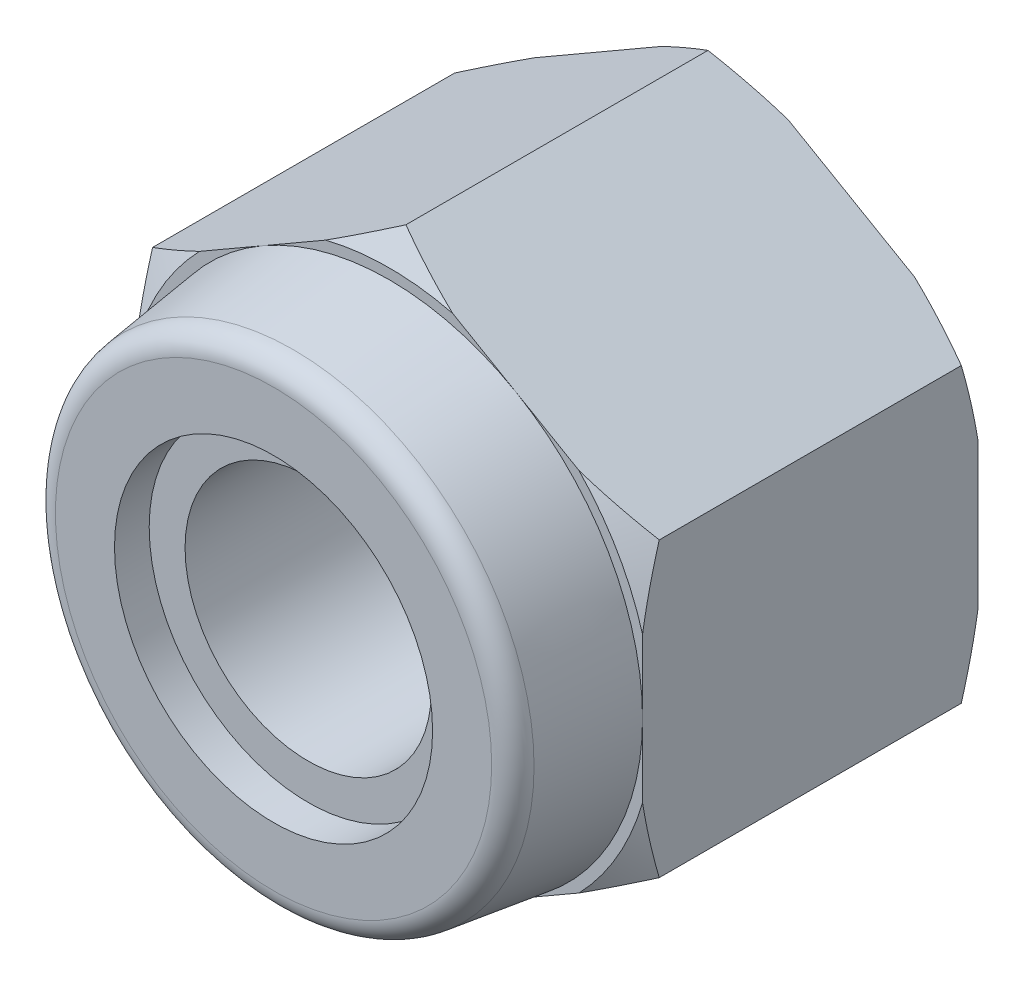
ISO-10303-21;
HEADER;
FILE_DESCRIPTION(('STEP AP214'),'2;1');
FILE_NAME('part.step','',(''),(''),'','','');
FILE_SCHEMA(('AUTOMOTIVE_DESIGN { 1 0 10303 214 1 1 1 1 }'));
ENDSEC;
DATA;
#1=APPLICATION_CONTEXT('core data for automotive mechanical design processes');
#2=APPLICATION_PROTOCOL_DEFINITION('international standard','automotive_design',2000,#1);
#3=PRODUCT_CONTEXT('',#1,'mechanical');
#4=PRODUCT('Part','Part','',(#3));
#5=PRODUCT_RELATED_PRODUCT_CATEGORY('part','',(#4));
#6=PRODUCT_DEFINITION_FORMATION('','',#4);
#7=PRODUCT_DEFINITION_CONTEXT('part definition',#1,'design');
#8=PRODUCT_DEFINITION('design','',#6,#7);
#9=PRODUCT_DEFINITION_SHAPE('','',#8);
#10=(LENGTH_UNIT() NAMED_UNIT(*) SI_UNIT(.MILLI.,.METRE.));
#11=(NAMED_UNIT(*) PLANE_ANGLE_UNIT() SI_UNIT($,.RADIAN.));
#12=(NAMED_UNIT(*) SI_UNIT($,.STERADIAN.) SOLID_ANGLE_UNIT());
#13=UNCERTAINTY_MEASURE_WITH_UNIT(LENGTH_MEASURE(1.E-05),#10,'distance_accuracy_value','');
#14=(GEOMETRIC_REPRESENTATION_CONTEXT(3) GLOBAL_UNCERTAINTY_ASSIGNED_CONTEXT((#13)) GLOBAL_UNIT_ASSIGNED_CONTEXT((#10,
#11,#12)) REPRESENTATION_CONTEXT('',''));
#15=CARTESIAN_POINT('',(0.,0.,0.));
#16=DIRECTION('',(0.,0.,1.));
#17=DIRECTION('',(1.,0.,0.));
#18=AXIS2_PLACEMENT_3D('',#15,#16,#17);
#19=CARTESIAN_POINT('',(5.56259999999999,-3.21156860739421,0.));
#20=DIRECTION('',(0.,0.,1.));
#21=DIRECTION('',(1.,0.,0.));
#22=AXIS2_PLACEMENT_3D('',#19,#20,#21);
#23=PLANE('',#22);
#24=DIRECTION('',(0.,1.,0.));
#25=VECTOR('',#24,1.);
#26=CARTESIAN_POINT('',(5.56259999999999,-3.21156860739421,0.));
#27=LINE('',#26,#25);
#28=CARTESIAN_POINT('',(5.56260000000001,0.,0.));
#29=VERTEX_POINT('',#28);
#30=CARTESIAN_POINT('',(5.56259999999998,1.60000426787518,0.));
#31=VERTEX_POINT('',#30);
#32=EDGE_CURVE('E498',#29,#31,#27,.T.);
#33=ORIENTED_EDGE('',*,*,#32,.T.);
#34=CARTESIAN_POINT('',(0.,0.,0.));
#35=DIRECTION('',(0.,0.,1.));
#36=DIRECTION('',(1.,0.,0.));
#37=AXIS2_PLACEMENT_3D('',#34,#35,#36);
#38=CIRCLE('',#37,5.78813721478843);
#39=CARTESIAN_POINT('',(4.16694434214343,4.01735077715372,0.));
#40=VERTEX_POINT('',#39);
#41=EDGE_CURVE('E193',#31,#40,#38,.T.);
#42=ORIENTED_EDGE('',*,*,#41,.T.);
#43=DIRECTION('',(-0.866025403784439,0.5,0.));
#44=VECTOR('',#43,1.);
#45=CARTESIAN_POINT('',(5.56259999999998,3.21156860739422,0.));
#46=LINE('',#45,#44);
#47=CARTESIAN_POINT('',(2.7813,4.81735291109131,0.));
#48=VERTEX_POINT('',#47);
#49=EDGE_CURVE('E206',#40,#48,#46,.T.);
#50=ORIENTED_EDGE('',*,*,#49,.T.);
#51=CARTESIAN_POINT('',(0.,0.,0.));
#52=DIRECTION('',(0.,0.,1.));
#53=DIRECTION('',(1.,0.,0.));
#54=AXIS2_PLACEMENT_3D('',#51,#52,#53);
#55=CIRCLE('',#54,5.56260000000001);
#56=EDGE_CURVE('E244',#29,#48,#55,.T.);
#57=ORIENTED_EDGE('',*,*,#56,.F.);
#58=EDGE_LOOP('',(#33,#42,#50,#57));
#59=FACE_BOUND('',#58,.T.);
#60=ADVANCED_FACE('F44',(#59),#23,.T.);
#61=CARTESIAN_POINT('',(1.39565565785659,5.61735504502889,0.));
#62=VERTEX_POINT('',#61);
#63=EDGE_CURVE('E505',#48,#62,#46,.T.);
#64=ORIENTED_EDGE('',*,*,#63,.T.);
#65=CARTESIAN_POINT('',(-1.39565565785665,5.61735504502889,0.));
#66=VERTEX_POINT('',#65);
#67=EDGE_CURVE('E468',#62,#66,#38,.T.);
#68=ORIENTED_EDGE('',*,*,#67,.T.);
#69=DIRECTION('',(-0.866025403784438,-0.500000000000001,0.));
#70=VECTOR('',#69,1.);
#71=CARTESIAN_POINT('',(0.,6.42313721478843,0.));
#72=LINE('',#71,#70);
#73=CARTESIAN_POINT('',(-2.78130000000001,4.81735291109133,0.));
#74=VERTEX_POINT('',#73);
#75=EDGE_CURVE('E504',#66,#74,#72,.T.);
#76=ORIENTED_EDGE('',*,*,#75,.T.);
#77=EDGE_CURVE('E237',#48,#74,#55,.T.);
#78=ORIENTED_EDGE('',*,*,#77,.F.);
#79=EDGE_LOOP('',(#64,#68,#76,#78));
#80=FACE_BOUND('',#79,.T.);
#81=ADVANCED_FACE('F399',(#80),#23,.T.);
#82=CARTESIAN_POINT('',(-4.16694434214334,4.0173507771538,0.));
#83=VERTEX_POINT('',#82);
#84=EDGE_CURVE('E503',#74,#83,#72,.T.);
#85=ORIENTED_EDGE('',*,*,#84,.T.);
#86=CARTESIAN_POINT('',(-5.56260000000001,1.60000426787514,0.));
#87=VERTEX_POINT('',#86);
#88=EDGE_CURVE('E466',#83,#87,#38,.T.);
#89=ORIENTED_EDGE('',*,*,#88,.T.);
#90=DIRECTION('',(0.,-1.,0.));
#91=VECTOR('',#90,1.);
#92=CARTESIAN_POINT('',(-5.56260000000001,3.21156860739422,0.));
#93=LINE('',#92,#91);
#94=CARTESIAN_POINT('',(-5.56260000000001,0.,0.));
#95=VERTEX_POINT('',#94);
#96=EDGE_CURVE('E300',#87,#95,#93,.T.);
#97=ORIENTED_EDGE('',*,*,#96,.T.);
#98=EDGE_CURVE('E245',#74,#95,#55,.T.);
#99=ORIENTED_EDGE('',*,*,#98,.F.);
#100=EDGE_LOOP('',(#85,#89,#97,#99));
#101=FACE_BOUND('',#100,.T.);
#102=ADVANCED_FACE('F517',(#101),#23,.T.);
#103=CARTESIAN_POINT('',(-5.56260000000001,-1.6000042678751,0.));
#104=VERTEX_POINT('',#103);
#105=EDGE_CURVE('E507',#95,#104,#93,.T.);
#106=ORIENTED_EDGE('',*,*,#105,.T.);
#107=CARTESIAN_POINT('',(-4.16694434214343,-4.01735077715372,0.));
#108=VERTEX_POINT('',#107);
#109=EDGE_CURVE('E69',#104,#108,#38,.T.);
#110=ORIENTED_EDGE('',*,*,#109,.T.);
#111=DIRECTION('',(0.866025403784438,-0.5,0.));
#112=VECTOR('',#111,1.);
#113=CARTESIAN_POINT('',(-5.56260000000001,-3.2115686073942,0.));
#114=LINE('',#113,#112);
#115=CARTESIAN_POINT('',(-2.7813,-4.81735291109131,0.));
#116=VERTEX_POINT('',#115);
#117=EDGE_CURVE('E274',#108,#116,#114,.T.);
#118=ORIENTED_EDGE('',*,*,#117,.T.);
#119=EDGE_CURVE('E246',#95,#116,#55,.T.);
#120=ORIENTED_EDGE('',*,*,#119,.F.);
#121=EDGE_LOOP('',(#106,#110,#118,#120));
#122=FACE_BOUND('',#121,.T.);
#123=ADVANCED_FACE('F514',(#122),#23,.T.);
#124=CARTESIAN_POINT('',(-1.3956556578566,-5.61735504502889,0.));
#125=VERTEX_POINT('',#124);
#126=EDGE_CURVE('E510',#116,#125,#114,.T.);
#127=ORIENTED_EDGE('',*,*,#126,.T.);
#128=CARTESIAN_POINT('',(1.39565565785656,-5.61735504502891,0.));
#129=VERTEX_POINT('',#128);
#130=EDGE_CURVE('E62',#125,#129,#38,.T.);
#131=ORIENTED_EDGE('',*,*,#130,.T.);
#132=DIRECTION('',(0.866025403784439,0.5,0.));
#133=VECTOR('',#132,1.);
#134=CARTESIAN_POINT('',(0.,-6.42313721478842,0.));
#135=LINE('',#134,#133);
#136=CARTESIAN_POINT('',(2.7813,-4.81735291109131,0.));
#137=VERTEX_POINT('',#136);
#138=EDGE_CURVE('E496',#129,#137,#135,.T.);
#139=ORIENTED_EDGE('',*,*,#138,.T.);
#140=EDGE_CURVE('E265',#116,#137,#55,.T.);
#141=ORIENTED_EDGE('',*,*,#140,.F.);
#142=EDGE_LOOP('',(#127,#131,#139,#141));
#143=FACE_BOUND('',#142,.T.);
#144=ADVANCED_FACE('F619',(#143),#23,.T.);
#145=CARTESIAN_POINT('',(0.,-6.42313721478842,-7.366));
#146=DIRECTION('',(0.5,-0.866025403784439,0.));
#147=DIRECTION('',(0.866025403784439,0.5,0.));
#148=AXIS2_PLACEMENT_3D('',#145,#146,#147);
#149=PLANE('',#148);
#150=DIRECTION('',(0.,0.,1.));
#151=VECTOR('',#150,1.);
#152=CARTESIAN_POINT('',(5.56259999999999,-3.21156860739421,-7.366));
#153=LINE('',#152,#151);
#154=CARTESIAN_POINT('',(5.56259999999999,-3.21156860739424,-6.99938257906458));
#155=VERTEX_POINT('',#154);
#156=CARTESIAN_POINT('',(5.56259999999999,-3.21156860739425,-0.366617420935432));
#157=VERTEX_POINT('',#156);
#158=EDGE_CURVE('E220',#155,#157,#153,.T.);
#159=ORIENTED_EDGE('',*,*,#158,.T.);
#160=CARTESIAN_POINT('',(9.42295491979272,-0.982791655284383,-2.12807296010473));
#161=CARTESIAN_POINT('',(9.2481954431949,-1.08368908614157,-2.03378314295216));
#162=CARTESIAN_POINT('',(9.07301757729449,-1.18482807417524,-1.94051140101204));
#163=CARTESIAN_POINT('',(8.72164863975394,-1.38769102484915,-1.75648219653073));
#164=CARTESIAN_POINT('',(8.54545744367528,-1.489415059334,-1.66572505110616));
#165=CARTESIAN_POINT('',(8.19136127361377,-1.69385257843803,-1.48694033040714));
#166=CARTESIAN_POINT('',(8.01345261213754,-1.7965681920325,-1.39892246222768));
#167=CARTESIAN_POINT('',(7.65630184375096,-2.00276928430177,-1.22657910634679));
#168=CARTESIAN_POINT('',(7.47705977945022,-2.10625473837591,-1.14225350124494));
#169=CARTESIAN_POINT('',(7.11245871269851,-2.31675726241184,-0.976019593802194));
#170=CARTESIAN_POINT('',(6.92705994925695,-2.42379728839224,-0.894227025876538));
#171=CARTESIAN_POINT('',(6.55439179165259,-2.63895734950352,-0.736473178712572));
#172=CARTESIAN_POINT('',(6.3671223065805,-2.7470774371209,-0.660512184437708));
#173=CARTESIAN_POINT('',(5.99066950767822,-2.96442256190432,-0.515868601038));
#174=CARTESIAN_POINT('',(5.80148823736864,-3.07364641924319,-0.447178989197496));
#175=CARTESIAN_POINT('',(5.42090459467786,-3.29337648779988,-0.318664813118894));
#176=CARTESIAN_POINT('',(5.22950251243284,-3.40388253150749,-0.258839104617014));
#177=CARTESIAN_POINT('',(4.7717339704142,-3.6681753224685,-0.129442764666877));
#178=CARTESIAN_POINT('',(4.50430080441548,-3.82257793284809,-0.0646967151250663));
#179=CARTESIAN_POINT('',(4.10041076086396,-4.05576395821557,0.0130990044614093));
#180=CARTESIAN_POINT('',(3.96532631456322,-4.13375499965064,0.0358101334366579));
#181=CARTESIAN_POINT('',(3.69441769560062,-4.29016416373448,0.0742198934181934));
#182=CARTESIAN_POINT('',(3.55859362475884,-4.36858222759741,0.0899194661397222));
#183=CARTESIAN_POINT('',(3.28802057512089,-4.52479765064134,0.11371955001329));
#184=CARTESIAN_POINT('',(3.15327727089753,-4.6025917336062,0.121905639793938));
#185=CARTESIAN_POINT('',(2.88360480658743,-4.75828720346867,0.130744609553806));
#186=CARTESIAN_POINT('',(2.74867564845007,-4.8361885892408,0.13139756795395));
#187=CARTESIAN_POINT('',(2.47894976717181,-4.99191489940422,0.125149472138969));
#188=CARTESIAN_POINT('',(2.34415304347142,-5.06973982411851,0.118248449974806));
#189=CARTESIAN_POINT('',(2.07497866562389,-5.22514772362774,0.0971012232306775));
#190=CARTESIAN_POINT('',(1.94060107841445,-5.30273065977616,0.082853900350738));
#191=CARTESIAN_POINT('',(1.62309471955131,-5.48604304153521,0.0408724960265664));
#192=CARTESIAN_POINT('',(1.44026472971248,-5.59159998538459,0.0101022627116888));
#193=CARTESIAN_POINT('',(1.07635581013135,-5.80170289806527,-0.0630230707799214));
#194=CARTESIAN_POINT('',(0.895277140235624,-5.90624871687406,-0.105379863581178));
#195=CARTESIAN_POINT('',(0.534892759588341,-6.11431673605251,-0.20007922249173));
#196=CARTESIAN_POINT('',(0.355589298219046,-6.2178376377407,-0.252433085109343));
#197=CARTESIAN_POINT('',(-0.00100447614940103,-6.42371714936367,-0.365477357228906));
#198=CARTESIAN_POINT('',(-0.178294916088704,-6.52607583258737,-0.42616723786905));
#199=CARTESIAN_POINT('',(-0.533083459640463,-6.73091309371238,-0.555205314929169));
#200=CARTESIAN_POINT('',(-0.710558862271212,-6.83337856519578,-0.62363615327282));
#201=CARTESIAN_POINT('',(-1.06362951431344,-7.03722400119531,-0.766239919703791));
#202=CARTESIAN_POINT('',(-1.23922592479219,-7.13860463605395,-0.840409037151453));
#203=CARTESIAN_POINT('',(-1.58881849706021,-7.34044200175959,-0.993471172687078));
#204=CARTESIAN_POINT('',(-1.76281498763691,-7.4408989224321,-1.07236319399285));
#205=CARTESIAN_POINT('',(-2.10944403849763,-7.64102529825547,-1.23404436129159));
#206=CARTESIAN_POINT('',(-2.28207657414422,-7.74069473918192,-1.31683357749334));
#207=CARTESIAN_POINT('',(-2.57291488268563,-7.90861031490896,-1.45951571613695));
#208=CARTESIAN_POINT('',(-2.69143196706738,-7.97703618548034,-1.51856612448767));
#209=CARTESIAN_POINT('',(-2.92794924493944,-8.11358949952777,-1.63801912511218));
#210=CARTESIAN_POINT('',(-3.04594945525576,-8.18171695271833,-1.69842167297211));
#211=CARTESIAN_POINT('',(-3.28024937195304,-8.3169900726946,-1.81977975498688));
#212=CARTESIAN_POINT('',(-3.39655392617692,-8.38413853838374,-1.88072282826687));
#213=CARTESIAN_POINT('',(-3.62875242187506,-8.51819840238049,-2.00364973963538));
#214=CARTESIAN_POINT('',(-3.74464635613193,-8.58510979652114,-2.06563359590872));
#215=CARTESIAN_POINT('',(-3.86035491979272,-8.65191416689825,-2.12807296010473));
#216=B_SPLINE_CURVE_WITH_KNOTS('',3,(#160,#161,#162,#163,#164,#165,#166,#167,#168,#169,#170,
#171,#172,#173,#174,#175,#176,#177,#178,#179,#180,#181,#182,#183,#184,#185,#186,#187,#188,#189,
#190,#191,#192,#193,#194,#195,#196,#197,#198,#199,#200,#201,#202,#203,#204,#205,#206,#207,#208,
#209,#210,#211,#212,#213,#214,#215),.UNSPECIFIED.,.F.,.F.,(4,2,2,2,2,2,2,2,2,2,2,2,2,2,2,2,2,2,
2,2,2,2,2,2,2,2,2,4),(0.,0.668217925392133,1.33651973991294,2.00696882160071,2.67739656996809,
3.36484632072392,4.05232964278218,4.73914281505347,5.42586724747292,6.37139841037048,
6.84414816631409,7.31683440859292,7.78406740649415,8.25129554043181,8.71852169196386,
9.18581898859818,9.82546536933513,10.4652052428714,11.1056723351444,11.7460988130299,
12.3941569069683,13.0417882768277,13.6892834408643,14.3367902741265,14.7839276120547,
15.2310502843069,15.6734793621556,16.1159161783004),.UNSPECIFIED.);
#217=CARTESIAN_POINT('',(4.1669443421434,-4.01735077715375,0.));
#218=VERTEX_POINT('',#217);
#219=EDGE_CURVE('E198',#157,#218,#216,.T.);
#220=ORIENTED_EDGE('',*,*,#219,.T.);
#221=EDGE_CURVE('E497',#137,#218,#135,.T.);
#222=ORIENTED_EDGE('',*,*,#221,.F.);
#223=ORIENTED_EDGE('',*,*,#138,.F.);
#224=CARTESIAN_POINT('',(0.,-6.42313721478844,-0.366617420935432));
#225=VERTEX_POINT('',#224);
#226=EDGE_CURVE('E451',#129,#225,#216,.T.);
#227=ORIENTED_EDGE('',*,*,#226,.T.);
#228=DIRECTION('',(0.,0.,1.));
#229=VECTOR('',#228,1.);
#230=CARTESIAN_POINT('',(0.,-6.42313721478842,-7.366));
#231=LINE('',#230,#229);
#232=CARTESIAN_POINT('',(0.,-6.42313721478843,-6.99938257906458));
#233=VERTEX_POINT('',#232);
#234=EDGE_CURVE('E261',#233,#225,#231,.T.);
#235=ORIENTED_EDGE('',*,*,#234,.F.);
#236=CARTESIAN_POINT('',(9.42295491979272,-0.982791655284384,-5.23792703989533));
#237=CARTESIAN_POINT('',(9.24819544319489,-1.08368908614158,-5.33221685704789));
#238=CARTESIAN_POINT('',(9.07301757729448,-1.18482807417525,-5.42548859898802));
#239=CARTESIAN_POINT('',(8.72164863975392,-1.38769102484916,-5.60951780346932));
#240=CARTESIAN_POINT('',(8.54545744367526,-1.48941505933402,-5.70027494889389));
#241=CARTESIAN_POINT('',(8.19136127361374,-1.69385257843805,-5.87905966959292));
#242=CARTESIAN_POINT('',(8.01345261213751,-1.79656819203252,-5.96707753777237));
#243=CARTESIAN_POINT('',(7.65630184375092,-2.0027692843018,-6.13942089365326));
#244=CARTESIAN_POINT('',(7.47705977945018,-2.10625473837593,-6.2237464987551));
#245=CARTESIAN_POINT('',(7.11245871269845,-2.31675726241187,-6.38998040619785));
#246=CARTESIAN_POINT('',(6.9270599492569,-2.42379728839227,-6.47177297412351));
#247=CARTESIAN_POINT('',(6.55439179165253,-2.63895734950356,-6.62952682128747));
#248=CARTESIAN_POINT('',(6.36712230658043,-2.74707743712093,-6.70548781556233));
#249=CARTESIAN_POINT('',(5.99066950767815,-2.96442256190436,-6.85013139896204));
#250=CARTESIAN_POINT('',(5.80148823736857,-3.07364641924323,-6.91882101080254));
#251=CARTESIAN_POINT('',(5.42090459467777,-3.29337648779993,-7.04733518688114));
#252=CARTESIAN_POINT('',(5.22950251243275,-3.40388253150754,-7.10716089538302));
#253=CARTESIAN_POINT('',(4.7717339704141,-3.66817532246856,-7.23655723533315));
#254=CARTESIAN_POINT('',(4.50430080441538,-3.82257793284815,-7.30130328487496));
#255=CARTESIAN_POINT('',(4.10041076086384,-4.05576395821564,-7.37909900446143));
#256=CARTESIAN_POINT('',(3.96532631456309,-4.13375499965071,-7.40181013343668));
#257=CARTESIAN_POINT('',(3.69441769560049,-4.29016416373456,-7.44021989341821));
#258=CARTESIAN_POINT('',(3.5585936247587,-4.36858222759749,-7.45591946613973));
#259=CARTESIAN_POINT('',(3.28802057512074,-4.52479765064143,-7.4797195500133));
#260=CARTESIAN_POINT('',(3.15327727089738,-4.60259173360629,-7.48790563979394));
#261=CARTESIAN_POINT('',(2.88360480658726,-4.75828720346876,-7.4967446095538));
#262=CARTESIAN_POINT('',(2.7486756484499,-4.8361885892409,-7.49739756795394));
#263=CARTESIAN_POINT('',(2.47894976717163,-4.99191489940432,-7.49114947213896));
#264=CARTESIAN_POINT('',(2.34415304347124,-5.06973982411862,-7.48424844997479));
#265=CARTESIAN_POINT('',(2.0749786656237,-5.22514772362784,-7.46310122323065));
#266=CARTESIAN_POINT('',(1.94060107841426,-5.30273065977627,-7.44885390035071));
#267=CARTESIAN_POINT('',(1.6230947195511,-5.48604304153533,-7.40687249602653));
#268=CARTESIAN_POINT('',(1.44026472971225,-5.59159998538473,-7.37610226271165));
#269=CARTESIAN_POINT('',(1.07635581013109,-5.80170289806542,-7.30297692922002));
#270=CARTESIAN_POINT('',(0.895277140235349,-5.90624871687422,-7.26062013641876));
#271=CARTESIAN_POINT('',(0.534892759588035,-6.11431673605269,-7.16592077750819));
#272=CARTESIAN_POINT('',(0.355589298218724,-6.21783763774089,-7.11356691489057));
#273=CARTESIAN_POINT('',(-0.00100447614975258,-6.42371714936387,-7.00052264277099));
#274=CARTESIAN_POINT('',(-0.17829491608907,-6.52607583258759,-6.93983276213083));
#275=CARTESIAN_POINT('',(-0.533083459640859,-6.73091309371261,-6.81079468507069));
#276=CARTESIAN_POINT('',(-0.710558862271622,-6.83337856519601,-6.74236384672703));
#277=CARTESIAN_POINT('',(-1.06362951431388,-7.03722400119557,-6.59976008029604));
#278=CARTESIAN_POINT('',(-1.23922592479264,-7.13860463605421,-6.52559096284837));
#279=CARTESIAN_POINT('',(-1.58881849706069,-7.34044200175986,-6.37252882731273));
#280=CARTESIAN_POINT('',(-1.76281498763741,-7.44089892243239,-6.29363680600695));
#281=CARTESIAN_POINT('',(-2.10944403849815,-7.64102529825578,-6.13195563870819));
#282=CARTESIAN_POINT('',(-2.28207657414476,-7.74069473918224,-6.04916642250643));
#283=CARTESIAN_POINT('',(-2.57291488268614,-7.90861031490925,-5.90648428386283));
#284=CARTESIAN_POINT('',(-2.69143196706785,-7.9770361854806,-5.84743387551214));
#285=CARTESIAN_POINT('',(-2.9279492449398,-8.11358949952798,-5.72798087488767));
#286=CARTESIAN_POINT('',(-3.04594945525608,-8.18171695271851,-5.66757832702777));
#287=CARTESIAN_POINT('',(-3.28024937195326,-8.31699007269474,-5.54622024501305));
#288=CARTESIAN_POINT('',(-3.3965539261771,-8.38413853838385,-5.48527717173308));
#289=CARTESIAN_POINT('',(-3.62875242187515,-8.51819840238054,-5.36235026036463));
#290=CARTESIAN_POINT('',(-3.74464635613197,-8.58510979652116,-5.30036640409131));
#291=CARTESIAN_POINT('',(-3.86035491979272,-8.65191416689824,-5.23792703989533));
#292=B_SPLINE_CURVE_WITH_KNOTS('',3,(#236,#237,#238,#239,#240,#241,#242,#243,#244,#245,#246,
#247,#248,#249,#250,#251,#252,#253,#254,#255,#256,#257,#258,#259,#260,#261,#262,#263,#264,#265,
#266,#267,#268,#269,#270,#271,#272,#273,#274,#275,#276,#277,#278,#279,#280,#281,#282,#283,#284,
#285,#286,#287,#288,#289,#290,#291),.UNSPECIFIED.,.F.,.F.,(4,2,2,2,2,2,2,2,2,2,2,2,2,2,2,2,2,2,
2,2,2,2,2,2,2,2,2,4),(0.,0.668217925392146,1.33651973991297,2.00696882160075,2.67739656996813,
3.36484632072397,4.05232964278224,4.73914281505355,5.42586724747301,6.37139841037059,
6.84414816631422,7.31683440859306,7.7840674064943,8.25129554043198,8.71852169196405,
9.18581898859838,9.82546536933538,10.4652052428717,11.1056723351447,11.7460988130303,
12.3941569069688,13.0417882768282,13.6892834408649,14.3367902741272,14.7839276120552,
15.2310502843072,15.6734793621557,16.1159161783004),.UNSPECIFIED.);
#293=CARTESIAN_POINT('',(1.39565565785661,-5.6173550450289,-7.36599999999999));
#294=VERTEX_POINT('',#293);
#295=EDGE_CURVE('E255',#294,#233,#292,.T.);
#296=ORIENTED_EDGE('',*,*,#295,.F.);
#297=DIRECTION('',(0.866025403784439,0.5,0.));
#298=VECTOR('',#297,1.);
#299=CARTESIAN_POINT('',(0.,-6.42313721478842,-7.366));
#300=LINE('',#299,#298);
#301=CARTESIAN_POINT('',(4.16694434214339,-4.01735077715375,-7.366));
#302=VERTEX_POINT('',#301);
#303=EDGE_CURVE('E485',#294,#302,#300,.T.);
#304=ORIENTED_EDGE('',*,*,#303,.T.);
#305=EDGE_CURVE('E263',#155,#302,#292,.T.);
#306=ORIENTED_EDGE('',*,*,#305,.F.);
#307=EDGE_LOOP('',(#159,#220,#222,#223,#227,#235,#296,#304,#306));
#308=FACE_BOUND('',#307,.T.);
#309=ADVANCED_FACE('F50',(#308),#149,.T.);
#310=CARTESIAN_POINT('',(-5.56260000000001,-3.2115686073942,-7.366));
#311=DIRECTION('',(-0.5,-0.866025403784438,0.));
#312=DIRECTION('',(0.866025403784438,-0.5,0.));
#313=AXIS2_PLACEMENT_3D('',#310,#311,#312);
#314=PLANE('',#313);
#315=ORIENTED_EDGE('',*,*,#234,.T.);
#316=CARTESIAN_POINT('',(3.86035491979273,-8.65191416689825,-2.12807296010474));
#317=CARTESIAN_POINT('',(3.68559544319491,-8.55101673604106,-2.03378314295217));
#318=CARTESIAN_POINT('',(3.5104175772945,-8.44987774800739,-1.94051140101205));
#319=CARTESIAN_POINT('',(3.15904863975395,-8.24701479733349,-1.75648219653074));
#320=CARTESIAN_POINT('',(2.9828574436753,-8.14529076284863,-1.66572505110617));
#321=CARTESIAN_POINT('',(2.62876127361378,-7.9408532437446,-1.48694033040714));
#322=CARTESIAN_POINT('',(2.45085261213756,-7.83813763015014,-1.39892246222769));
#323=CARTESIAN_POINT('',(2.09370184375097,-7.63193653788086,-1.22657910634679));
#324=CARTESIAN_POINT('',(1.91445977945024,-7.52845108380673,-1.14225350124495));
#325=CARTESIAN_POINT('',(1.54985871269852,-7.3179485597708,-0.9760195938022));
#326=CARTESIAN_POINT('',(1.36445994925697,-7.21090853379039,-0.894227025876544));
#327=CARTESIAN_POINT('',(0.991791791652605,-6.99574847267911,-0.736473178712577));
#328=CARTESIAN_POINT('',(0.804522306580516,-6.88762838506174,-0.660512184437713));
#329=CARTESIAN_POINT('',(0.428069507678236,-6.67028326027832,-0.515868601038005));
#330=CARTESIAN_POINT('',(0.238888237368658,-6.56105940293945,-0.4471789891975));
#331=CARTESIAN_POINT('',(-0.141695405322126,-6.34132933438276,-0.318664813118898));
#332=CARTESIAN_POINT('',(-0.333097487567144,-6.23082329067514,-0.258839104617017));
#333=CARTESIAN_POINT('',(-0.790866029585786,-5.96653049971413,-0.12944276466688));
#334=CARTESIAN_POINT('',(-1.0582991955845,-5.81212788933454,-0.064696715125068));
#335=CARTESIAN_POINT('',(-1.46218923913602,-5.57894186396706,0.0130990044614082));
#336=CARTESIAN_POINT('',(-1.59727368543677,-5.500950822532,0.0358101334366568));
#337=CARTESIAN_POINT('',(-1.86818230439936,-5.34454165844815,0.0742198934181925));
#338=CARTESIAN_POINT('',(-2.00400637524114,-5.26612359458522,0.0899194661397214));
#339=CARTESIAN_POINT('',(-2.27457942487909,-5.10990817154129,0.11371955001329));
#340=CARTESIAN_POINT('',(-2.40932272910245,-5.03211408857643,0.121905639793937));
#341=CARTESIAN_POINT('',(-2.67899519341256,-4.87641861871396,0.130744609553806));
#342=CARTESIAN_POINT('',(-2.81392435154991,-4.79851723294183,0.131397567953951));
#343=CARTESIAN_POINT('',(-3.08365023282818,-4.64279092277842,0.12514947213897));
#344=CARTESIAN_POINT('',(-3.21844695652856,-4.56496599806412,0.118248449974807));
#345=CARTESIAN_POINT('',(-3.4876213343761,-4.4095580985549,0.0971012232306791));
#346=CARTESIAN_POINT('',(-3.62199892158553,-4.33197516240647,0.0828539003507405));
#347=CARTESIAN_POINT('',(-3.93950528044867,-4.14866278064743,0.0408724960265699));
#348=CARTESIAN_POINT('',(-4.1223352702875,-4.04310583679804,0.010102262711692));
#349=CARTESIAN_POINT('',(-4.48624418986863,-3.83300292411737,-0.0630230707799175));
#350=CARTESIAN_POINT('',(-4.66732285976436,-3.72845710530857,-0.105379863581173));
#351=CARTESIAN_POINT('',(-5.02770724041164,-3.52038908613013,-0.200079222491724));
#352=CARTESIAN_POINT('',(-5.20701070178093,-3.41686818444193,-0.252433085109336));
#353=CARTESIAN_POINT('',(-5.56360447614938,-3.21098867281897,-0.365477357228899));
#354=CARTESIAN_POINT('',(-5.74089491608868,-3.10862998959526,-0.426167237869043));
#355=CARTESIAN_POINT('',(-6.09568345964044,-2.90379272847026,-0.55520531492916));
#356=CARTESIAN_POINT('',(-6.27315886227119,-2.80132725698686,-0.623636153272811));
#357=CARTESIAN_POINT('',(-6.62622951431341,-2.59748182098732,-0.766239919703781));
#358=CARTESIAN_POINT('',(-6.80182592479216,-2.49610118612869,-0.840409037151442));
#359=CARTESIAN_POINT('',(-7.15141849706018,-2.29426382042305,-0.993471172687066));
#360=CARTESIAN_POINT('',(-7.32541498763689,-2.19380689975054,-1.07236319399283));
#361=CARTESIAN_POINT('',(-7.67204403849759,-1.99368052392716,-1.23404436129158));
#362=CARTESIAN_POINT('',(-7.84467657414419,-1.89401108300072,-1.31683357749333));
#363=CARTESIAN_POINT('',(-8.1355148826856,-1.72609550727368,-1.45951571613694));
#364=CARTESIAN_POINT('',(-8.25403196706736,-1.6576696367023,-1.51856612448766));
#365=CARTESIAN_POINT('',(-8.49054924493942,-1.52111632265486,-1.63801912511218));
#366=CARTESIAN_POINT('',(-8.60854945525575,-1.4529888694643,-1.69842167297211));
#367=CARTESIAN_POINT('',(-8.84284937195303,-1.31771574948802,-1.81977975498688));
#368=CARTESIAN_POINT('',(-8.95915392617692,-1.25056728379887,-1.88072282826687));
#369=CARTESIAN_POINT('',(-9.19135242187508,-1.11650741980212,-2.00364973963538));
#370=CARTESIAN_POINT('',(-9.30724635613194,-1.04959602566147,-2.06563359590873));
#371=CARTESIAN_POINT('',(-9.42295491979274,-0.982791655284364,-2.12807296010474));
#372=B_SPLINE_CURVE_WITH_KNOTS('',3,(#316,#317,#318,#319,#320,#321,#322,#323,#324,#325,#326,
#327,#328,#329,#330,#331,#332,#333,#334,#335,#336,#337,#338,#339,#340,#341,#342,#343,#344,#345,
#346,#347,#348,#349,#350,#351,#352,#353,#354,#355,#356,#357,#358,#359,#360,#361,#362,#363,#364,
#365,#366,#367,#368,#369,#370,#371),.UNSPECIFIED.,.F.,.F.,(4,2,2,2,2,2,2,2,2,2,2,2,2,2,2,2,2,2,
2,2,2,2,2,2,2,2,2,4),(0.,0.668217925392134,1.33651973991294,2.00696882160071,2.67739656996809,
3.36484632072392,4.05232964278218,4.73914281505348,5.42586724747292,6.37139841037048,
6.8441481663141,7.31683440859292,7.78406740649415,8.25129554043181,8.71852169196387,
9.18581898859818,9.82546536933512,10.4652052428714,11.1056723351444,11.7460988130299,
12.3941569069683,13.0417882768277,13.6892834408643,14.3367902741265,14.7839276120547,
15.2310502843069,15.6734793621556,16.1159161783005),.UNSPECIFIED.);
#373=EDGE_CURVE('E462',#225,#125,#372,.T.);
#374=ORIENTED_EDGE('',*,*,#373,.T.);
#375=ORIENTED_EDGE('',*,*,#126,.F.);
#376=ORIENTED_EDGE('',*,*,#117,.F.);
#377=CARTESIAN_POINT('',(-5.56260000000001,-3.21156860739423,-0.366617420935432));
#378=VERTEX_POINT('',#377);
#379=EDGE_CURVE('E305',#108,#378,#372,.T.);
#380=ORIENTED_EDGE('',*,*,#379,.T.);
#381=DIRECTION('',(0.,0.,1.));
#382=VECTOR('',#381,1.);
#383=CARTESIAN_POINT('',(-5.56260000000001,-3.2115686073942,-7.366));
#384=LINE('',#383,#382);
#385=CARTESIAN_POINT('',(-5.56260000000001,-3.21156860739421,-6.99938257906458));
#386=VERTEX_POINT('',#385);
#387=EDGE_CURVE('E270',#386,#378,#384,.T.);
#388=ORIENTED_EDGE('',*,*,#387,.F.);
#389=CARTESIAN_POINT('',(3.86035491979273,-8.65191416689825,-5.23792703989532));
#390=CARTESIAN_POINT('',(3.68559544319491,-8.55101673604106,-5.33221685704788));
#391=CARTESIAN_POINT('',(3.51041757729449,-8.44987774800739,-5.42548859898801));
#392=CARTESIAN_POINT('',(3.15904863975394,-8.24701479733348,-5.60951780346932));
#393=CARTESIAN_POINT('',(2.98285744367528,-8.14529076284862,-5.70027494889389));
#394=CARTESIAN_POINT('',(2.62876127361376,-7.94085324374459,-5.87905966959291));
#395=CARTESIAN_POINT('',(2.45085261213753,-7.83813763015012,-5.96707753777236));
#396=CARTESIAN_POINT('',(2.09370184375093,-7.63193653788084,-6.13942089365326));
#397=CARTESIAN_POINT('',(1.9144597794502,-7.5284510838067,-6.2237464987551));
#398=CARTESIAN_POINT('',(1.54985871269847,-7.31794855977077,-6.38998040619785));
#399=CARTESIAN_POINT('',(1.36445994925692,-7.21090853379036,-6.4717729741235));
#400=CARTESIAN_POINT('',(0.991791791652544,-6.99574847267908,-6.62952682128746));
#401=CARTESIAN_POINT('',(0.804522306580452,-6.8876283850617,-6.70548781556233));
#402=CARTESIAN_POINT('',(0.428069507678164,-6.67028326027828,-6.85013139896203));
#403=CARTESIAN_POINT('',(0.238888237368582,-6.5610594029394,-6.91882101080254));
#404=CARTESIAN_POINT('',(-0.141695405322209,-6.34132933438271,-7.04733518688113));
#405=CARTESIAN_POINT('',(-0.333097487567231,-6.23082329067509,-7.10716089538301));
#406=CARTESIAN_POINT('',(-0.790866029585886,-5.96653049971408,-7.23655723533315));
#407=CARTESIAN_POINT('',(-1.05829919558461,-5.81212788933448,-7.30130328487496));
#408=CARTESIAN_POINT('',(-1.46218923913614,-5.57894186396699,-7.37909900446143));
#409=CARTESIAN_POINT('',(-1.59727368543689,-5.50095082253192,-7.40181013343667));
#410=CARTESIAN_POINT('',(-1.86818230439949,-5.34454165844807,-7.44021989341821));
#411=CARTESIAN_POINT('',(-2.00400637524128,-5.26612359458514,-7.45591946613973));
#412=CARTESIAN_POINT('',(-2.27457942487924,-5.1099081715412,-7.47971955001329));
#413=CARTESIAN_POINT('',(-2.4093227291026,-5.03211408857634,-7.48790563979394));
#414=CARTESIAN_POINT('',(-2.67899519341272,-4.87641861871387,-7.4967446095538));
#415=CARTESIAN_POINT('',(-2.81392435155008,-4.79851723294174,-7.49739756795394));
#416=CARTESIAN_POINT('',(-3.08365023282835,-4.64279092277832,-7.49114947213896));
#417=CARTESIAN_POINT('',(-3.21844695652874,-4.56496599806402,-7.48424844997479));
#418=CARTESIAN_POINT('',(-3.48762133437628,-4.40955809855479,-7.46310122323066));
#419=CARTESIAN_POINT('',(-3.62199892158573,-4.33197516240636,-7.44885390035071));
#420=CARTESIAN_POINT('',(-3.93950528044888,-4.1486627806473,-7.40687249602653));
#421=CARTESIAN_POINT('',(-4.12233527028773,-4.04310583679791,-7.37610226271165));
#422=CARTESIAN_POINT('',(-4.48624418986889,-3.83300292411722,-7.30297692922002));
#423=CARTESIAN_POINT('',(-4.66732285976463,-3.72845710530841,-7.26062013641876));
#424=CARTESIAN_POINT('',(-5.02770724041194,-3.52038908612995,-7.16592077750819));
#425=CARTESIAN_POINT('',(-5.20701070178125,-3.41686818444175,-7.11356691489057));
#426=CARTESIAN_POINT('',(-5.56360447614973,-3.21098867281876,-7.00052264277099));
#427=CARTESIAN_POINT('',(-5.74089491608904,-3.10862998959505,-6.93983276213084));
#428=CARTESIAN_POINT('',(-6.09568345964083,-2.90379272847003,-6.8107946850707));
#429=CARTESIAN_POINT('',(-6.27315886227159,-2.80132725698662,-6.74236384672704));
#430=CARTESIAN_POINT('',(-6.62622951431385,-2.59748182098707,-6.59976008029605));
#431=CARTESIAN_POINT('',(-6.80182592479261,-2.49610118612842,-6.52559096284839));
#432=CARTESIAN_POINT('',(-7.15141849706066,-2.29426382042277,-6.37252882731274));
#433=CARTESIAN_POINT('',(-7.32541498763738,-2.19380689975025,-6.29363680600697));
#434=CARTESIAN_POINT('',(-7.67204403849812,-1.99368052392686,-6.1319556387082));
#435=CARTESIAN_POINT('',(-7.84467657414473,-1.8940110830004,-6.04916642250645));
#436=CARTESIAN_POINT('',(-8.13551488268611,-1.72609550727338,-5.90648428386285));
#437=CARTESIAN_POINT('',(-8.25403196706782,-1.65766963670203,-5.84743387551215));
#438=CARTESIAN_POINT('',(-8.49054924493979,-1.52111632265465,-5.72798087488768));
#439=CARTESIAN_POINT('',(-8.60854945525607,-1.45298886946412,-5.66757832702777));
#440=CARTESIAN_POINT('',(-8.84284937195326,-1.31771574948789,-5.54622024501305));
#441=CARTESIAN_POINT('',(-8.95915392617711,-1.25056728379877,-5.48527717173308));
#442=CARTESIAN_POINT('',(-9.19135242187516,-1.11650741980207,-5.36235026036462));
#443=CARTESIAN_POINT('',(-9.30724635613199,-1.04959602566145,-5.3003664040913));
#444=CARTESIAN_POINT('',(-9.42295491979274,-0.982791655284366,-5.23792703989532));
#445=B_SPLINE_CURVE_WITH_KNOTS('',3,(#389,#390,#391,#392,#393,#394,#395,#396,#397,#398,#399,
#400,#401,#402,#403,#404,#405,#406,#407,#408,#409,#410,#411,#412,#413,#414,#415,#416,#417,#418,
#419,#420,#421,#422,#423,#424,#425,#426,#427,#428,#429,#430,#431,#432,#433,#434,#435,#436,#437,
#438,#439,#440,#441,#442,#443,#444),.UNSPECIFIED.,.F.,.F.,(4,2,2,2,2,2,2,2,2,2,2,2,2,2,2,2,2,2,
2,2,2,2,2,2,2,2,2,4),(0.,0.668217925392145,1.33651973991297,2.00696882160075,2.67739656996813,
3.36484632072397,4.05232964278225,4.73914281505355,5.42586724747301,6.37139841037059,
6.84414816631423,7.31683440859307,7.78406740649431,8.25129554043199,8.71852169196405,
9.18581898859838,9.82546536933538,10.4652052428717,11.1056723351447,11.7460988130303,
12.3941569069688,13.0417882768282,13.6892834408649,14.3367902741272,14.7839276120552,
15.2310502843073,15.6734793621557,16.1159161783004),.UNSPECIFIED.);
#446=CARTESIAN_POINT('',(-4.1669443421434,-4.01735077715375,-7.36599999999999));
#447=VERTEX_POINT('',#446);
#448=EDGE_CURVE('E383',#447,#386,#445,.T.);
#449=ORIENTED_EDGE('',*,*,#448,.F.);
#450=DIRECTION('',(0.866025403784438,-0.5,0.));
#451=VECTOR('',#450,1.);
#452=CARTESIAN_POINT('',(-5.56260000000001,-3.2115686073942,-7.366));
#453=LINE('',#452,#451);
#454=CARTESIAN_POINT('',(-1.39565565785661,-5.61735504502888,-7.366));
#455=VERTEX_POINT('',#454);
#456=EDGE_CURVE('E224',#447,#455,#453,.T.);
#457=ORIENTED_EDGE('',*,*,#456,.T.);
#458=EDGE_CURVE('E260',#233,#455,#445,.T.);
#459=ORIENTED_EDGE('',*,*,#458,.F.);
#460=EDGE_LOOP('',(#315,#374,#375,#376,#380,#388,#449,#457,#459));
#461=FACE_BOUND('',#460,.T.);
#462=ADVANCED_FACE('F388',(#461),#314,.T.);
#463=CARTESIAN_POINT('',(-5.56260000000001,3.21156860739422,-7.366));
#464=DIRECTION('',(-1.,0.,0.));
#465=DIRECTION('',(0.,0.,1.));
#466=AXIS2_PLACEMENT_3D('',#463,#464,#465);
#467=PLANE('',#466);
#468=ORIENTED_EDGE('',*,*,#387,.T.);
#469=CARTESIAN_POINT('',(-5.56260000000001,-7.07192352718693,-1.85291411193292));
#470=CARTESIAN_POINT('',(-5.56260000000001,-6.87097025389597,-1.76174762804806));
#471=CARTESIAN_POINT('',(-5.56260000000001,-6.66946705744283,-1.67177020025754));
#472=CARTESIAN_POINT('',(-5.56260000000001,-6.26512525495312,-1.49477044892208));
#473=CARTESIAN_POINT('',(-5.56260000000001,-6.06228641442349,-1.40774866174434));
#474=CARTESIAN_POINT('',(-5.56260000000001,-5.65425901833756,-1.23691416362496));
#475=CARTESIAN_POINT('',(-5.56260000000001,-5.44906418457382,-1.15311638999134));
#476=CARTESIAN_POINT('',(-5.56260000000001,-5.03693928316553,-0.989913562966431));
#477=CARTESIAN_POINT('',(-5.56260000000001,-4.83000929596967,-0.91050830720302));
#478=CARTESIAN_POINT('',(-5.56260000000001,-4.41509364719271,-0.757413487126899));
#479=CARTESIAN_POINT('',(-5.56260000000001,-4.20711692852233,-0.683699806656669));
#480=CARTESIAN_POINT('',(-5.56260000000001,-3.78893999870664,-0.54279195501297));
#481=CARTESIAN_POINT('',(-5.56260000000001,-3.5787396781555,-0.47559810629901));
#482=CARTESIAN_POINT('',(-5.56260000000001,-3.15622600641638,-0.349272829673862));
#483=CARTESIAN_POINT('',(-5.56260000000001,-2.9439159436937,-0.290130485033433));
#484=CARTESIAN_POINT('',(-5.56260000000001,-2.51681893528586,-0.181481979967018));
#485=CARTESIAN_POINT('',(-5.56260000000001,-2.30203209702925,-0.131975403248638));
#486=CARTESIAN_POINT('',(-5.56260000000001,-1.93121852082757,-0.056800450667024));
#487=CARTESIAN_POINT('',(-5.56260000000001,-1.77575550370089,-0.0283501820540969));
#488=CARTESIAN_POINT('',(-5.56260000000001,-1.46378877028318,0.0220044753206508));
#489=CARTESIAN_POINT('',(-5.56260000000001,-1.3072852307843,0.0439099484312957));
#490=CARTESIAN_POINT('',(-5.56260000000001,-0.993468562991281,0.0806018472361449));
#491=CARTESIAN_POINT('',(-5.56260000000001,-0.836155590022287,0.0953895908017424));
#492=CARTESIAN_POINT('',(-5.56260000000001,-0.52099759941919,0.117422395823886));
#493=CARTESIAN_POINT('',(-5.56260000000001,-0.36315258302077,0.124667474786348));
#494=CARTESIAN_POINT('',(-5.56260000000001,-0.0473755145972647,0.131388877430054));
#495=CARTESIAN_POINT('',(-5.56260000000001,0.110556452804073,0.130869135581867));
#496=CARTESIAN_POINT('',(-5.56260000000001,0.426201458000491,0.122087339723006));
#497=CARTESIAN_POINT('',(-5.56260000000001,0.583914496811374,0.11382532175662));
#498=CARTESIAN_POINT('',(-5.56260000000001,0.898771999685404,0.0898109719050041));
#499=CARTESIAN_POINT('',(-5.56260000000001,1.05591644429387,0.0740583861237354));
#500=CARTESIAN_POINT('',(-5.56260000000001,1.36935158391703,0.0355176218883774));
#501=CARTESIAN_POINT('',(-5.56260000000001,1.5256421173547,0.0127281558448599));
#502=CARTESIAN_POINT('',(-5.56260000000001,2.14801290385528,-0.0912516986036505));
#503=CARTESIAN_POINT('',(-5.56260000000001,2.60990723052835,-0.198231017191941));
#504=CARTESIAN_POINT('',(-5.56260000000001,3.29422291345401,-0.388910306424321));
#505=CARTESIAN_POINT('',(-5.56260000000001,3.5212027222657,-0.457616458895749));
#506=CARTESIAN_POINT('',(-5.56260000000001,3.97254729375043,-0.603200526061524));
#507=CARTESIAN_POINT('',(-5.56260000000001,4.19691223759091,-0.680077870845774));
#508=CARTESIAN_POINT('',(-5.56260000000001,4.64579679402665,-0.841306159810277));
#509=CARTESIAN_POINT('',(-5.56260000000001,4.87028905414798,-0.925732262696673));
#510=CARTESIAN_POINT('',(-5.56260000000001,5.31717982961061,-1.09998110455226));
#511=CARTESIAN_POINT('',(-5.56260000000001,5.53957821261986,-1.18980418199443));
#512=CARTESIAN_POINT('',(-5.56260000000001,5.98119192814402,-1.37321957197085));
#513=CARTESIAN_POINT('',(-5.56260000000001,6.20041844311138,-1.46678510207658));
#514=CARTESIAN_POINT('',(-5.56260000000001,6.63728388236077,-1.65741326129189));
#515=CARTESIAN_POINT('',(-5.56260000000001,6.85492318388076,-1.75447502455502));
#516=CARTESIAN_POINT('',(-5.56260000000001,7.07192352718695,-1.85291411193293));
#517=B_SPLINE_CURVE_WITH_KNOTS('',3,(#469,#470,#471,#472,#473,#474,#475,#476,#477,#478,#479,
#480,#481,#482,#483,#484,#485,#486,#487,#488,#489,#490,#491,#492,#493,#494,#495,#496,#497,#498,
#499,#500,#501,#502,#503,#504,#505,#506,#507,#508,#509,#510,#511,#512,#513,#514,#515,#516),
.UNSPECIFIED.,.F.,.F.,(4,2,2,2,2,2,2,2,2,2,2,2,2,2,2,2,2,2,2,2,2,2,2,4),(0.,0.662008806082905,
1.32413711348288,1.98903360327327,2.65389943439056,3.31577290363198,3.97767909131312,
4.63867869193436,5.29964972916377,5.77366318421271,6.24759806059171,6.72144515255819,
7.19529114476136,7.6688970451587,8.14250074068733,8.61612049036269,9.08982695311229,
10.5088436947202,11.2202428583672,11.9315924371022,12.6510452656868,13.3705432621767,
14.0855862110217,14.800453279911),.UNSPECIFIED.);
#518=EDGE_CURVE('E302',#378,#104,#517,.T.);
#519=ORIENTED_EDGE('',*,*,#518,.T.);
#520=ORIENTED_EDGE('',*,*,#105,.F.);
#521=ORIENTED_EDGE('',*,*,#96,.F.);
#522=CARTESIAN_POINT('',(-5.56260000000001,3.21156860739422,-0.366617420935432));
#523=VERTEX_POINT('',#522);
#524=EDGE_CURVE('E297',#87,#523,#517,.T.);
#525=ORIENTED_EDGE('',*,*,#524,.T.);
#526=DIRECTION('',(0.,0.,1.));
#527=VECTOR('',#526,1.);
#528=CARTESIAN_POINT('',(-5.56260000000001,3.21156860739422,-7.366));
#529=LINE('',#528,#527);
#530=CARTESIAN_POINT('',(-5.5626,3.21156860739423,-6.99938257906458));
#531=VERTEX_POINT('',#530);
#532=EDGE_CURVE('E219',#531,#523,#529,.T.);
#533=ORIENTED_EDGE('',*,*,#532,.F.);
#534=CARTESIAN_POINT('',(-5.56260000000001,-7.07192352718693,-5.51308588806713));
#535=CARTESIAN_POINT('',(-5.56260000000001,-6.87097025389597,-5.60425237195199));
#536=CARTESIAN_POINT('',(-5.56260000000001,-6.66946705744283,-5.69422979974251));
#537=CARTESIAN_POINT('',(-5.56260000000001,-6.26512525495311,-5.87122955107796));
#538=CARTESIAN_POINT('',(-5.56260000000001,-6.06228641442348,-5.95825133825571));
#539=CARTESIAN_POINT('',(-5.56260000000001,-5.65425901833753,-6.12908583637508));
#540=CARTESIAN_POINT('',(-5.56260000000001,-5.44906418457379,-6.2128836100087));
#541=CARTESIAN_POINT('',(-5.56260000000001,-5.0369392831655,-6.37608643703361));
#542=CARTESIAN_POINT('',(-5.56260000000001,-4.83000929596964,-6.45549169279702));
#543=CARTESIAN_POINT('',(-5.56260000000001,-4.41509364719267,-6.60858651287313));
#544=CARTESIAN_POINT('',(-5.56260000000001,-4.20711692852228,-6.68230019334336));
#545=CARTESIAN_POINT('',(-5.56260000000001,-3.78893999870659,-6.82320804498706));
#546=CARTESIAN_POINT('',(-5.56260000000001,-3.57873967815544,-6.89040189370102));
#547=CARTESIAN_POINT('',(-5.56260000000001,-3.15622600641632,-7.01672717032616));
#548=CARTESIAN_POINT('',(-5.56260000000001,-2.94391594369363,-7.07586951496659));
#549=CARTESIAN_POINT('',(-5.56260000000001,-2.51681893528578,-7.184518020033));
#550=CARTESIAN_POINT('',(-5.56260000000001,-2.30203209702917,-7.23402459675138));
#551=CARTESIAN_POINT('',(-5.56260000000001,-1.93121852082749,-7.30919954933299));
#552=CARTESIAN_POINT('',(-5.56260000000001,-1.7757555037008,-7.33764981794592));
#553=CARTESIAN_POINT('',(-5.56260000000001,-1.46378877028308,-7.38800447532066));
#554=CARTESIAN_POINT('',(-5.56260000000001,-1.30728523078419,-7.40990994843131));
#555=CARTESIAN_POINT('',(-5.56260000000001,-0.993468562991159,-7.44660184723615));
#556=CARTESIAN_POINT('',(-5.56260000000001,-0.83615559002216,-7.46138959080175));
#557=CARTESIAN_POINT('',(-5.56260000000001,-0.520997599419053,-7.48342239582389));
#558=CARTESIAN_POINT('',(-5.56260000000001,-0.363152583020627,-7.49066747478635));
#559=CARTESIAN_POINT('',(-5.56260000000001,-0.0473755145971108,-7.49738887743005));
#560=CARTESIAN_POINT('',(-5.56260000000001,0.110556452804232,-7.49686913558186));
#561=CARTESIAN_POINT('',(-5.56260000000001,0.42620145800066,-7.48808733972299));
#562=CARTESIAN_POINT('',(-5.56260000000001,0.583914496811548,-7.4798253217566));
#563=CARTESIAN_POINT('',(-5.56260000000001,0.898771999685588,-7.45581097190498));
#564=CARTESIAN_POINT('',(-5.56260000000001,1.05591644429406,-7.44005838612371));
#565=CARTESIAN_POINT('',(-5.56260000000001,1.36935158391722,-7.40151762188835));
#566=CARTESIAN_POINT('',(-5.56260000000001,1.52564211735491,-7.37872815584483));
#567=CARTESIAN_POINT('',(-5.56260000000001,2.14801290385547,-7.27474830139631));
#568=CARTESIAN_POINT('',(-5.56260000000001,2.60990723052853,-7.16776898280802));
#569=CARTESIAN_POINT('',(-5.56260000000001,3.29422291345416,-6.97708969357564));
#570=CARTESIAN_POINT('',(-5.56260000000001,3.52120272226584,-6.90838354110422));
#571=CARTESIAN_POINT('',(-5.56260000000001,3.97254729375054,-6.76279947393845));
#572=CARTESIAN_POINT('',(-5.56260000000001,4.19691223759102,-6.6859221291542));
#573=CARTESIAN_POINT('',(-5.56260000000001,4.64579679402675,-6.52469384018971));
#574=CARTESIAN_POINT('',(-5.56260000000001,4.87028905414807,-6.44026773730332));
#575=CARTESIAN_POINT('',(-5.56260000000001,5.31717982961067,-6.26601889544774));
#576=CARTESIAN_POINT('',(-5.56260000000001,5.53957821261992,-6.17619581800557));
#577=CARTESIAN_POINT('',(-5.56260000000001,5.98119192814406,-5.99278042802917));
#578=CARTESIAN_POINT('',(-5.56260000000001,6.20041844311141,-5.89921489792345));
#579=CARTESIAN_POINT('',(-5.56260000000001,6.63728388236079,-5.70858673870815));
#580=CARTESIAN_POINT('',(-5.56260000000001,6.85492318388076,-5.61152497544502));
#581=CARTESIAN_POINT('',(-5.56260000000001,7.07192352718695,-5.51308588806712));
#582=B_SPLINE_CURVE_WITH_KNOTS('',3,(#534,#535,#536,#537,#538,#539,#540,#541,#542,#543,#544,
#545,#546,#547,#548,#549,#550,#551,#552,#553,#554,#555,#556,#557,#558,#559,#560,#561,#562,#563,
#564,#565,#566,#567,#568,#569,#570,#571,#572,#573,#574,#575,#576,#577,#578,#579,#580,#581),
.UNSPECIFIED.,.F.,.F.,(4,2,2,2,2,2,2,2,2,2,2,2,2,2,2,2,2,2,2,2,2,2,2,4),(0.,0.662008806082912,
1.3241371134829,1.9890336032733,2.65389943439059,3.31577290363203,3.97767909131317,
4.63867869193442,5.29964972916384,5.7736631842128,6.24759806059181,6.7214451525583,
7.19529114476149,7.66889704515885,8.1425007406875,8.61612049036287,9.08982695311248,
10.5088436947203,11.2202428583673,11.9315924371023,12.6510452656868,13.3705432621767,
14.0855862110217,14.800453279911),.UNSPECIFIED.);
#583=CARTESIAN_POINT('',(-5.56260000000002,1.60000426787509,-7.36599999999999));
#584=VERTEX_POINT('',#583);
#585=EDGE_CURVE('E293',#584,#531,#582,.T.);
#586=ORIENTED_EDGE('',*,*,#585,.F.);
#587=DIRECTION('',(0.,-1.,0.));
#588=VECTOR('',#587,1.);
#589=CARTESIAN_POINT('',(-5.56260000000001,3.21156860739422,-7.366));
#590=LINE('',#589,#588);
#591=CARTESIAN_POINT('',(-5.56260000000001,-1.60000426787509,-7.366));
#592=VERTEX_POINT('',#591);
#593=EDGE_CURVE('E495',#584,#592,#590,.T.);
#594=ORIENTED_EDGE('',*,*,#593,.T.);
#595=EDGE_CURVE('E384',#386,#592,#582,.T.);
#596=ORIENTED_EDGE('',*,*,#595,.F.);
#597=EDGE_LOOP('',(#468,#519,#520,#521,#525,#533,#586,#594,#596));
#598=FACE_BOUND('',#597,.T.);
#599=ADVANCED_FACE('F292',(#598),#467,.T.);
#600=CARTESIAN_POINT('',(0.,6.42313721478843,-7.366));
#601=DIRECTION('',(-0.500000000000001,0.866025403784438,0.));
#602=DIRECTION('',(-0.866025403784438,-0.500000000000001,0.));
#603=AXIS2_PLACEMENT_3D('',#600,#601,#602);
#604=PLANE('',#603);
#605=ORIENTED_EDGE('',*,*,#532,.T.);
#606=CARTESIAN_POINT('',(-9.42295491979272,0.982791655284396,-2.12807296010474));
#607=CARTESIAN_POINT('',(-9.2481954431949,1.08368908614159,-2.03378314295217));
#608=CARTESIAN_POINT('',(-9.07301757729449,1.18482807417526,-1.94051140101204));
#609=CARTESIAN_POINT('',(-8.72164863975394,1.38769102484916,-1.75648219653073));
#610=CARTESIAN_POINT('',(-8.54545744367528,1.48941505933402,-1.66572505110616));
#611=CARTESIAN_POINT('',(-8.19136127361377,1.69385257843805,-1.48694033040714));
#612=CARTESIAN_POINT('',(-8.01345261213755,1.79656819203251,-1.39892246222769));
#613=CARTESIAN_POINT('',(-7.65630184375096,2.00276928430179,-1.22657910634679));
#614=CARTESIAN_POINT('',(-7.47705977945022,2.10625473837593,-1.14225350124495));
#615=CARTESIAN_POINT('',(-7.11245871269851,2.31675726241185,-0.976019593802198));
#616=CARTESIAN_POINT('',(-6.92705994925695,2.42379728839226,-0.894227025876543));
#617=CARTESIAN_POINT('',(-6.55439179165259,2.63895734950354,-0.736473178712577));
#618=CARTESIAN_POINT('',(-6.3671223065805,2.74707743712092,-0.660512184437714));
#619=CARTESIAN_POINT('',(-5.99066950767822,2.96442256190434,-0.515868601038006));
#620=CARTESIAN_POINT('',(-5.80148823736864,3.07364641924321,-0.447178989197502));
#621=CARTESIAN_POINT('',(-5.42090459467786,3.2933764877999,-0.318664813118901));
#622=CARTESIAN_POINT('',(-5.22950251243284,3.40388253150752,-0.25883910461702));
#623=CARTESIAN_POINT('',(-4.77173397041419,3.66817532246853,-0.129442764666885));
#624=CARTESIAN_POINT('',(-4.50430080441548,3.82257793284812,-0.0646967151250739));
#625=CARTESIAN_POINT('',(-4.10041076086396,4.0557639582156,0.0130990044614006));
#626=CARTESIAN_POINT('',(-3.96532631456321,4.13375499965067,0.0358101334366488));
#627=CARTESIAN_POINT('',(-3.69441769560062,4.29016416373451,0.0742198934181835));
#628=CARTESIAN_POINT('',(-3.55859362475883,4.36858222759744,0.0899194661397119));
#629=CARTESIAN_POINT('',(-3.28802057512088,4.52479765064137,0.113719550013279));
#630=CARTESIAN_POINT('',(-3.15327727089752,4.60259173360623,0.121905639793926));
#631=CARTESIAN_POINT('',(-2.88360480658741,4.7582872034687,0.130744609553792));
#632=CARTESIAN_POINT('',(-2.74867564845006,4.83618858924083,0.131397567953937));
#633=CARTESIAN_POINT('',(-2.47894976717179,4.99191489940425,0.125149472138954));
#634=CARTESIAN_POINT('',(-2.34415304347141,5.06973982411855,0.118248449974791));
#635=CARTESIAN_POINT('',(-2.07497866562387,5.22514772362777,0.0971012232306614));
#636=CARTESIAN_POINT('',(-1.94060107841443,5.30273065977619,0.0828539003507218));
#637=CARTESIAN_POINT('',(-1.6230947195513,5.48604304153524,0.0408724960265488));
#638=CARTESIAN_POINT('',(-1.44026472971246,5.59159998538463,0.0101022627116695));
#639=CARTESIAN_POINT('',(-1.07635581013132,5.80170289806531,-0.0630230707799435));
#640=CARTESIAN_POINT('',(-0.895277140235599,5.90624871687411,-0.105379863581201));
#641=CARTESIAN_POINT('',(-0.534892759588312,6.11431673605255,-0.200079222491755));
#642=CARTESIAN_POINT('',(-0.355589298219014,6.21783763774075,-0.252433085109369));
#643=CARTESIAN_POINT('',(0.0010044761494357,6.42371714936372,-0.365477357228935));
#644=CARTESIAN_POINT('',(0.17829491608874,6.52607583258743,-0.426167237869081));
#645=CARTESIAN_POINT('',(0.533083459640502,6.73091309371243,-0.555205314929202));
#646=CARTESIAN_POINT('',(0.710558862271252,6.83337856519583,-0.623636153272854));
#647=CARTESIAN_POINT('',(1.06362951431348,7.03722400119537,-0.766239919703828));
#648=CARTESIAN_POINT('',(1.23922592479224,7.13860463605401,-0.840409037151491));
#649=CARTESIAN_POINT('',(1.58881849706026,7.34044200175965,-0.993471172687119));
#650=CARTESIAN_POINT('',(1.76281498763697,7.44089892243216,-1.07236319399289));
#651=CARTESIAN_POINT('',(2.10944403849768,7.64102529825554,-1.23404436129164));
#652=CARTESIAN_POINT('',(2.28207657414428,7.74069473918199,-1.31683357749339));
#653=CARTESIAN_POINT('',(2.57291488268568,7.90861031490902,-1.459515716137));
#654=CARTESIAN_POINT('',(2.69143196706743,7.9770361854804,-1.51856612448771));
#655=CARTESIAN_POINT('',(2.92794924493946,8.11358949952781,-1.63801912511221));
#656=CARTESIAN_POINT('',(3.04594945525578,8.18171695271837,-1.69842167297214));
#657=CARTESIAN_POINT('',(3.28024937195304,8.31699007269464,-1.8197797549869));
#658=CARTESIAN_POINT('',(3.39655392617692,8.38413853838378,-1.88072282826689));
#659=CARTESIAN_POINT('',(3.62875242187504,8.51819840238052,-2.00364973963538));
#660=CARTESIAN_POINT('',(3.7446463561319,8.58510979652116,-2.06563359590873));
#661=CARTESIAN_POINT('',(3.86035491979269,8.65191416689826,-2.12807296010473));
#662=B_SPLINE_CURVE_WITH_KNOTS('',3,(#606,#607,#608,#609,#610,#611,#612,#613,#614,#615,#616,
#617,#618,#619,#620,#621,#622,#623,#624,#625,#626,#627,#628,#629,#630,#631,#632,#633,#634,#635,
#636,#637,#638,#639,#640,#641,#642,#643,#644,#645,#646,#647,#648,#649,#650,#651,#652,#653,#654,
#655,#656,#657,#658,#659,#660,#661),.UNSPECIFIED.,.F.,.F.,(4,2,2,2,2,2,2,2,2,2,2,2,2,2,2,2,2,2,
2,2,2,2,2,2,2,2,2,4),(0.,0.668217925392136,1.33651973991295,2.00696882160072,2.67739656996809,
3.36484632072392,4.05232964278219,4.73914281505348,5.42586724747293,6.37139841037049,
6.84414816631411,7.31683440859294,7.78406740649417,8.25129554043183,8.71852169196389,
9.1858189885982,9.82546536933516,10.4652052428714,11.1056723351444,11.74609881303,
12.3941569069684,13.0417882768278,13.6892834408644,14.3367902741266,14.7839276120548,
15.231050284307,15.6734793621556,16.1159161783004),.UNSPECIFIED.);
#663=EDGE_CURVE('E281',#523,#83,#662,.T.);
#664=ORIENTED_EDGE('',*,*,#663,.T.);
#665=ORIENTED_EDGE('',*,*,#84,.F.);
#666=ORIENTED_EDGE('',*,*,#75,.F.);
#667=CARTESIAN_POINT('',(0.,6.42313721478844,-0.366617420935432));
#668=VERTEX_POINT('',#667);
#669=EDGE_CURVE('E301',#66,#668,#662,.T.);
#670=ORIENTED_EDGE('',*,*,#669,.T.);
#671=DIRECTION('',(0.,0.,1.));
#672=VECTOR('',#671,1.);
#673=CARTESIAN_POINT('',(0.,6.42313721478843,-7.366));
#674=LINE('',#673,#672);
#675=CARTESIAN_POINT('',(0.,6.42313721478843,-6.99938257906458));
#676=VERTEX_POINT('',#675);
#677=EDGE_CURVE('E217',#676,#668,#674,.T.);
#678=ORIENTED_EDGE('',*,*,#677,.F.);
#679=CARTESIAN_POINT('',(-9.42295491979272,0.982791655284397,-5.23792703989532));
#680=CARTESIAN_POINT('',(-9.2481954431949,1.08368908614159,-5.33221685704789));
#681=CARTESIAN_POINT('',(-9.07301757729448,1.18482807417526,-5.42548859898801));
#682=CARTESIAN_POINT('',(-8.72164863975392,1.38769102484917,-5.60951780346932));
#683=CARTESIAN_POINT('',(-8.54545744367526,1.48941505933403,-5.70027494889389));
#684=CARTESIAN_POINT('',(-8.19136127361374,1.69385257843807,-5.87905966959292));
#685=CARTESIAN_POINT('',(-8.01345261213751,1.79656819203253,-5.96707753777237));
#686=CARTESIAN_POINT('',(-7.65630184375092,2.00276928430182,-6.13942089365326));
#687=CARTESIAN_POINT('',(-7.47705977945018,2.10625473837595,-6.2237464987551));
#688=CARTESIAN_POINT('',(-7.11245871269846,2.31675726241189,-6.38998040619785));
#689=CARTESIAN_POINT('',(-6.9270599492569,2.42379728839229,-6.4717729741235));
#690=CARTESIAN_POINT('',(-6.55439179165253,2.63895734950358,-6.62952682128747));
#691=CARTESIAN_POINT('',(-6.36712230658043,2.74707743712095,-6.70548781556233));
#692=CARTESIAN_POINT('',(-5.99066950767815,2.96442256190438,-6.85013139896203));
#693=CARTESIAN_POINT('',(-5.80148823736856,3.07364641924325,-6.91882101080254));
#694=CARTESIAN_POINT('',(-5.42090459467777,3.29337648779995,-7.04733518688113));
#695=CARTESIAN_POINT('',(-5.22950251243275,3.40388253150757,-7.10716089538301));
#696=CARTESIAN_POINT('',(-4.77173397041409,3.66817532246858,-7.23655723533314));
#697=CARTESIAN_POINT('',(-4.50430080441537,3.82257793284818,-7.30130328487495));
#698=CARTESIAN_POINT('',(-4.10041076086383,4.05576395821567,-7.37909900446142));
#699=CARTESIAN_POINT('',(-3.96532631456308,4.13375499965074,-7.40181013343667));
#700=CARTESIAN_POINT('',(-3.69441769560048,4.29016416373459,-7.4402198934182));
#701=CARTESIAN_POINT('',(-3.55859362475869,4.36858222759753,-7.45591946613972));
#702=CARTESIAN_POINT('',(-3.28802057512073,4.52479765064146,-7.47971955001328));
#703=CARTESIAN_POINT('',(-3.15327727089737,4.60259173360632,-7.48790563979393));
#704=CARTESIAN_POINT('',(-2.88360480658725,4.7582872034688,-7.49674460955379));
#705=CARTESIAN_POINT('',(-2.74867564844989,4.83618858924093,-7.49739756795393));
#706=CARTESIAN_POINT('',(-2.47894976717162,4.99191489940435,-7.49114947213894));
#707=CARTESIAN_POINT('',(-2.34415304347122,5.06973982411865,-7.48424844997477));
#708=CARTESIAN_POINT('',(-2.07497866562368,5.22514772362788,-7.46310122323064));
#709=CARTESIAN_POINT('',(-1.94060107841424,5.30273065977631,-7.4488539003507));
#710=CARTESIAN_POINT('',(-1.62309471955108,5.48604304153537,-7.40687249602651));
#711=CARTESIAN_POINT('',(-1.44026472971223,5.59159998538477,-7.37610226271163));
#712=CARTESIAN_POINT('',(-1.07635581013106,5.80170289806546,-7.30297692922));
#713=CARTESIAN_POINT('',(-0.895277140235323,5.90624871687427,-7.26062013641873));
#714=CARTESIAN_POINT('',(-0.534892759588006,6.11431673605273,-7.16592077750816));
#715=CARTESIAN_POINT('',(-0.355589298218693,6.21783763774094,-7.11356691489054));
#716=CARTESIAN_POINT('',(0.00100447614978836,6.42371714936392,-7.00052264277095));
#717=CARTESIAN_POINT('',(0.178294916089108,6.52607583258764,-6.9398327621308));
#718=CARTESIAN_POINT('',(0.533083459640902,6.73091309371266,-6.81079468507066));
#719=CARTESIAN_POINT('',(0.710558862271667,6.83337856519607,-6.742363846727));
#720=CARTESIAN_POINT('',(1.06362951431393,7.03722400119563,-6.59976008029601));
#721=CARTESIAN_POINT('',(1.23922592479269,7.13860463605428,-6.52559096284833));
#722=CARTESIAN_POINT('',(1.58881849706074,7.34044200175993,-6.37252882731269));
#723=CARTESIAN_POINT('',(1.76281498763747,7.44089892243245,-6.29363680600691));
#724=CARTESIAN_POINT('',(2.10944403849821,7.64102529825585,-6.13195563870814));
#725=CARTESIAN_POINT('',(2.28207657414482,7.74069473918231,-6.04916642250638));
#726=CARTESIAN_POINT('',(2.57291488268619,7.90861031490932,-5.90648428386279));
#727=CARTESIAN_POINT('',(2.69143196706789,7.97703618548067,-5.84743387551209));
#728=CARTESIAN_POINT('',(2.92794924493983,8.11358949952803,-5.72798087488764));
#729=CARTESIAN_POINT('',(3.0459494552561,8.18171695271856,-5.66757832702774));
#730=CARTESIAN_POINT('',(3.28024937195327,8.31699007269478,-5.54622024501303));
#731=CARTESIAN_POINT('',(3.3965539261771,8.38413853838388,-5.48527717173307));
#732=CARTESIAN_POINT('',(3.62875242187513,8.51819840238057,-5.36235026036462));
#733=CARTESIAN_POINT('',(3.74464635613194,8.58510979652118,-5.3003664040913));
#734=CARTESIAN_POINT('',(3.86035491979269,8.65191416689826,-5.23792703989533));
#735=B_SPLINE_CURVE_WITH_KNOTS('',3,(#679,#680,#681,#682,#683,#684,#685,#686,#687,#688,#689,
#690,#691,#692,#693,#694,#695,#696,#697,#698,#699,#700,#701,#702,#703,#704,#705,#706,#707,#708,
#709,#710,#711,#712,#713,#714,#715,#716,#717,#718,#719,#720,#721,#722,#723,#724,#725,#726,#727,
#728,#729,#730,#731,#732,#733,#734),.UNSPECIFIED.,.F.,.F.,(4,2,2,2,2,2,2,2,2,2,2,2,2,2,2,2,2,2,
2,2,2,2,2,2,2,2,2,4),(0.,0.668217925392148,1.33651973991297,2.00696882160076,2.67739656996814,
3.36484632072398,4.05232964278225,4.73914281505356,5.42586724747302,6.37139841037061,
6.84414816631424,7.31683440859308,7.78406740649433,8.25129554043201,8.71852169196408,
9.18581898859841,9.82546536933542,10.4652052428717,11.1056723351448,11.7460988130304,
12.3941569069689,13.0417882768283,13.689283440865,14.3367902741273,14.7839276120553,
15.2310502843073,15.6734793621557,16.1159161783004),.UNSPECIFIED.);
#736=CARTESIAN_POINT('',(-1.3956556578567,5.61735504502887,-7.36599999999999));
#737=VERTEX_POINT('',#736);
#738=EDGE_CURVE('E371',#737,#676,#735,.T.);
#739=ORIENTED_EDGE('',*,*,#738,.F.);
#740=DIRECTION('',(-0.866025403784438,-0.500000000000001,0.));
#741=VECTOR('',#740,1.);
#742=CARTESIAN_POINT('',(0.,6.42313721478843,-7.366));
#743=LINE('',#742,#741);
#744=CARTESIAN_POINT('',(-4.16694434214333,4.0173507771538,-7.366));
#745=VERTEX_POINT('',#744);
#746=EDGE_CURVE('E488',#737,#745,#743,.T.);
#747=ORIENTED_EDGE('',*,*,#746,.T.);
#748=EDGE_CURVE('E290',#531,#745,#735,.T.);
#749=ORIENTED_EDGE('',*,*,#748,.F.);
#750=EDGE_LOOP('',(#605,#664,#665,#666,#670,#678,#739,#747,#749));
#751=FACE_BOUND('',#750,.T.);
#752=ADVANCED_FACE('F285',(#751),#604,.T.);
#753=CARTESIAN_POINT('',(5.56259999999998,3.21156860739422,-7.366));
#754=DIRECTION('',(0.5,0.866025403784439,0.));
#755=DIRECTION('',(-0.866025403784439,0.5,0.));
#756=AXIS2_PLACEMENT_3D('',#753,#754,#755);
#757=PLANE('',#756);
#758=ORIENTED_EDGE('',*,*,#677,.T.);
#759=CARTESIAN_POINT('',(-3.86035491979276,8.65191416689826,-2.12807296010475));
#760=CARTESIAN_POINT('',(-3.68559544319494,8.55101673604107,-2.03378314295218));
#761=CARTESIAN_POINT('',(-3.51041757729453,8.4498777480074,-1.94051140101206));
#762=CARTESIAN_POINT('',(-3.15904863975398,8.2470147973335,-1.75648219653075));
#763=CARTESIAN_POINT('',(-2.98285744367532,8.14529076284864,-1.66572505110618));
#764=CARTESIAN_POINT('',(-2.62876127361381,7.94085324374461,-1.48694033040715));
#765=CARTESIAN_POINT('',(-2.45085261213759,7.83813763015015,-1.3989224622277));
#766=CARTESIAN_POINT('',(-2.093701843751,7.63193653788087,-1.2265791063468));
#767=CARTESIAN_POINT('',(-1.91445977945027,7.52845108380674,-1.14225350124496));
#768=CARTESIAN_POINT('',(-1.54985871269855,7.31794855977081,-0.97601959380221));
#769=CARTESIAN_POINT('',(-1.364459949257,7.21090853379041,-0.894227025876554));
#770=CARTESIAN_POINT('',(-0.991791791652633,6.99574847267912,-0.736473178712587));
#771=CARTESIAN_POINT('',(-0.804522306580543,6.88762838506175,-0.660512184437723));
#772=CARTESIAN_POINT('',(-0.428069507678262,6.67028326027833,-0.515868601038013));
#773=CARTESIAN_POINT('',(-0.238888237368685,6.56105940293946,-0.447178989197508));
#774=CARTESIAN_POINT('',(0.1416954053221,6.34132933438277,-0.318664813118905));
#775=CARTESIAN_POINT('',(0.333097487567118,6.23082329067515,-0.258839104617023));
#776=CARTESIAN_POINT('',(0.790866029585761,5.96653049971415,-0.129442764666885));
#777=CARTESIAN_POINT('',(1.05829919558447,5.81212788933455,-0.0646967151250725));
#778=CARTESIAN_POINT('',(1.46218923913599,5.57894186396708,0.0130990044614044));
#779=CARTESIAN_POINT('',(1.59727368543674,5.50095082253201,0.0358101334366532));
#780=CARTESIAN_POINT('',(1.86818230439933,5.34454165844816,0.0742198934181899));
#781=CARTESIAN_POINT('',(2.00400637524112,5.26612359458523,0.0899194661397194));
#782=CARTESIAN_POINT('',(2.27457942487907,5.1099081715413,0.113719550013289));
#783=CARTESIAN_POINT('',(2.40932272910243,5.03211408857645,0.121905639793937));
#784=CARTESIAN_POINT('',(2.67899519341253,4.87641861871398,0.130744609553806));
#785=CARTESIAN_POINT('',(2.81392435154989,4.79851723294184,0.131397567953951));
#786=CARTESIAN_POINT('',(3.08365023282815,4.64279092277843,0.125149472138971));
#787=CARTESIAN_POINT('',(3.21844695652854,4.56496599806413,0.118248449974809));
#788=CARTESIAN_POINT('',(3.48762133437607,4.40955809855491,0.0971012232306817));
#789=CARTESIAN_POINT('',(3.62199892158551,4.33197516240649,0.0828539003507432));
#790=CARTESIAN_POINT('',(3.93950528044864,4.14866278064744,0.0408724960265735));
#791=CARTESIAN_POINT('',(4.12233527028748,4.04310583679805,0.0101022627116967));
#792=CARTESIAN_POINT('',(4.48624418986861,3.83300292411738,-0.0630230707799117));
#793=CARTESIAN_POINT('',(4.66732285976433,3.72845710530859,-0.105379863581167));
#794=CARTESIAN_POINT('',(5.02770724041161,3.52038908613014,-0.200079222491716));
#795=CARTESIAN_POINT('',(5.2070107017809,3.41686818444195,-0.252433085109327));
#796=CARTESIAN_POINT('',(5.56360447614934,3.21098867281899,-0.365477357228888));
#797=CARTESIAN_POINT('',(5.74089491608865,3.10862998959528,-0.426167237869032));
#798=CARTESIAN_POINT('',(6.0956834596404,2.90379272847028,-0.555205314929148));
#799=CARTESIAN_POINT('',(6.27315886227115,2.80132725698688,-0.623636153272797));
#800=CARTESIAN_POINT('',(6.62622951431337,2.59748182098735,-0.766239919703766));
#801=CARTESIAN_POINT('',(6.80182592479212,2.49610118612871,-0.840409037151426));
#802=CARTESIAN_POINT('',(7.15141849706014,2.29426382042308,-0.993471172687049));
#803=CARTESIAN_POINT('',(7.32541498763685,2.19380689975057,-1.07236319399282));
#804=CARTESIAN_POINT('',(7.67204403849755,1.99368052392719,-1.23404436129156));
#805=CARTESIAN_POINT('',(7.84467657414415,1.89401108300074,-1.31683357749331));
#806=CARTESIAN_POINT('',(8.13551488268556,1.7260955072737,-1.45951571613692));
#807=CARTESIAN_POINT('',(8.25403196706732,1.65766963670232,-1.51856612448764));
#808=CARTESIAN_POINT('',(8.49054924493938,1.52111632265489,-1.63801912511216));
#809=CARTESIAN_POINT('',(8.60854945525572,1.45298886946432,-1.69842167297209));
#810=CARTESIAN_POINT('',(8.842849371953,1.31771574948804,-1.81977975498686));
#811=CARTESIAN_POINT('',(8.95915392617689,1.2505672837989,-1.88072282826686));
#812=CARTESIAN_POINT('',(9.19135242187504,1.11650741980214,-2.00364973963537));
#813=CARTESIAN_POINT('',(9.30724635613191,1.0495960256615,-2.06563359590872));
#814=CARTESIAN_POINT('',(9.42295491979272,0.982791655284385,-2.12807296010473));
#815=B_SPLINE_CURVE_WITH_KNOTS('',3,(#759,#760,#761,#762,#763,#764,#765,#766,#767,#768,#769,
#770,#771,#772,#773,#774,#775,#776,#777,#778,#779,#780,#781,#782,#783,#784,#785,#786,#787,#788,
#789,#790,#791,#792,#793,#794,#795,#796,#797,#798,#799,#800,#801,#802,#803,#804,#805,#806,#807,
#808,#809,#810,#811,#812,#813,#814),.UNSPECIFIED.,.F.,.F.,(4,2,2,2,2,2,2,2,2,2,2,2,2,2,2,2,2,2,
2,2,2,2,2,2,2,2,2,4),(0.,0.668217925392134,1.33651973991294,2.00696882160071,2.67739656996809,
3.36484632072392,4.05232964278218,4.73914281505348,5.42586724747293,6.37139841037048,
6.8441481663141,7.31683440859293,7.78406740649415,8.25129554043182,8.71852169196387,
9.18581898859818,9.82546536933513,10.4652052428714,11.1056723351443,11.7460988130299,
12.3941569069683,13.0417882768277,13.6892834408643,14.3367902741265,14.7839276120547,
15.2310502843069,15.6734793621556,16.1159161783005),.UNSPECIFIED.);
#816=EDGE_CURVE('E208',#668,#62,#815,.T.);
#817=ORIENTED_EDGE('',*,*,#816,.T.);
#818=ORIENTED_EDGE('',*,*,#63,.F.);
#819=ORIENTED_EDGE('',*,*,#49,.F.);
#820=CARTESIAN_POINT('',(5.56259999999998,3.21156860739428,-0.366617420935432));
#821=VERTEX_POINT('',#820);
#822=EDGE_CURVE('E191',#40,#821,#815,.T.);
#823=ORIENTED_EDGE('',*,*,#822,.T.);
#824=DIRECTION('',(0.,0.,1.));
#825=VECTOR('',#824,1.);
#826=CARTESIAN_POINT('',(5.56259999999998,3.21156860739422,-7.366));
#827=LINE('',#826,#825);
#828=CARTESIAN_POINT('',(5.56259999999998,3.21156860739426,-6.99938257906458));
#829=VERTEX_POINT('',#828);
#830=EDGE_CURVE('E210',#829,#821,#827,.T.);
#831=ORIENTED_EDGE('',*,*,#830,.F.);
#832=CARTESIAN_POINT('',(-3.86035491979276,8.65191416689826,-5.23792703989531));
#833=CARTESIAN_POINT('',(-3.68559544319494,8.55101673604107,-5.33221685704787));
#834=CARTESIAN_POINT('',(-3.51041757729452,8.4498777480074,-5.425488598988));
#835=CARTESIAN_POINT('',(-3.15904863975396,8.24701479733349,-5.60951780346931));
#836=CARTESIAN_POINT('',(-2.9828574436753,8.14529076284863,-5.70027494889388));
#837=CARTESIAN_POINT('',(-2.62876127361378,7.94085324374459,-5.8790596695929));
#838=CARTESIAN_POINT('',(-2.45085261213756,7.83813763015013,-5.96707753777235));
#839=CARTESIAN_POINT('',(-2.09370184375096,7.63193653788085,-6.13942089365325));
#840=CARTESIAN_POINT('',(-1.91445977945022,7.52845108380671,-6.22374649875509));
#841=CARTESIAN_POINT('',(-1.5498587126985,7.31794855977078,-6.38998040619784));
#842=CARTESIAN_POINT('',(-1.36445994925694,7.21090853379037,-6.47177297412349));
#843=CARTESIAN_POINT('',(-0.99179179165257,6.99574847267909,-6.62952682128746));
#844=CARTESIAN_POINT('',(-0.804522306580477,6.88762838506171,-6.70548781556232));
#845=CARTESIAN_POINT('',(-0.428069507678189,6.67028326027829,-6.85013139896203));
#846=CARTESIAN_POINT('',(-0.238888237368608,6.56105940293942,-6.91882101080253));
#847=CARTESIAN_POINT('',(0.141695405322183,6.34132933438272,-7.04733518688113));
#848=CARTESIAN_POINT('',(0.333097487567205,6.2308232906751,-7.10716089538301));
#849=CARTESIAN_POINT('',(0.79086602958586,5.96653049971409,-7.23655723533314));
#850=CARTESIAN_POINT('',(1.05829919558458,5.81212788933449,-7.30130328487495));
#851=CARTESIAN_POINT('',(1.46218923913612,5.578941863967,-7.37909900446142));
#852=CARTESIAN_POINT('',(1.59727368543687,5.50095082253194,-7.40181013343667));
#853=CARTESIAN_POINT('',(1.86818230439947,5.34454165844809,-7.4402198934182));
#854=CARTESIAN_POINT('',(2.00400637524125,5.26612359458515,-7.45591946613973));
#855=CARTESIAN_POINT('',(2.27457942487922,5.10990817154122,-7.47971955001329));
#856=CARTESIAN_POINT('',(2.40932272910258,5.03211408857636,-7.48790563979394));
#857=CARTESIAN_POINT('',(2.67899519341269,4.87641861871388,-7.4967446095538));
#858=CARTESIAN_POINT('',(2.81392435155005,4.79851723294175,-7.49739756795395));
#859=CARTESIAN_POINT('',(3.08365023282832,4.64279092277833,-7.49114947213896));
#860=CARTESIAN_POINT('',(3.21844695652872,4.56496599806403,-7.48424844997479));
#861=CARTESIAN_POINT('',(3.48762133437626,4.4095580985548,-7.46310122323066));
#862=CARTESIAN_POINT('',(3.6219989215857,4.33197516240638,-7.44885390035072));
#863=CARTESIAN_POINT('',(3.93950528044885,4.14866278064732,-7.40687249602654));
#864=CARTESIAN_POINT('',(4.1223352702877,4.04310583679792,-7.37610226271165));
#865=CARTESIAN_POINT('',(4.48624418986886,3.83300292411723,-7.30297692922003));
#866=CARTESIAN_POINT('',(4.6673228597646,3.72845710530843,-7.26062013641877));
#867=CARTESIAN_POINT('',(5.02770724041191,3.52038908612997,-7.1659207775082));
#868=CARTESIAN_POINT('',(5.20701070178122,3.41686818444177,-7.11356691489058));
#869=CARTESIAN_POINT('',(5.56360447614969,3.21098867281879,-7.000522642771));
#870=CARTESIAN_POINT('',(5.74089491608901,3.10862998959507,-6.93983276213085));
#871=CARTESIAN_POINT('',(6.09568345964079,2.90379272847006,-6.81079468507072));
#872=CARTESIAN_POINT('',(6.27315886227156,2.80132725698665,-6.74236384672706));
#873=CARTESIAN_POINT('',(6.62622951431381,2.5974818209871,-6.59976008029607));
#874=CARTESIAN_POINT('',(6.80182592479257,2.49610118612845,-6.5255909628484));
#875=CARTESIAN_POINT('',(7.15141849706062,2.2942638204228,-6.37252882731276));
#876=CARTESIAN_POINT('',(7.32541498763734,2.19380689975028,-6.29363680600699));
#877=CARTESIAN_POINT('',(7.67204403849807,1.99368052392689,-6.13195563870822));
#878=CARTESIAN_POINT('',(7.84467657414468,1.89401108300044,-6.04916642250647));
#879=CARTESIAN_POINT('',(8.13551488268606,1.72609550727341,-5.90648428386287));
#880=CARTESIAN_POINT('',(8.25403196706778,1.65766963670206,-5.84743387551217));
#881=CARTESIAN_POINT('',(8.49054924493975,1.52111632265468,-5.7279808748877));
#882=CARTESIAN_POINT('',(8.60854945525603,1.45298886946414,-5.66757832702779));
#883=CARTESIAN_POINT('',(8.84284937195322,1.31771574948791,-5.54622024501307));
#884=CARTESIAN_POINT('',(8.95915392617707,1.25056728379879,-5.4852771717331));
#885=CARTESIAN_POINT('',(9.19135242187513,1.11650741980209,-5.36235026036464));
#886=CARTESIAN_POINT('',(9.30724635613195,1.04959602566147,-5.30036640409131));
#887=CARTESIAN_POINT('',(9.42295491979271,0.982791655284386,-5.23792703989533));
#888=B_SPLINE_CURVE_WITH_KNOTS('',3,(#832,#833,#834,#835,#836,#837,#838,#839,#840,#841,#842,
#843,#844,#845,#846,#847,#848,#849,#850,#851,#852,#853,#854,#855,#856,#857,#858,#859,#860,#861,
#862,#863,#864,#865,#866,#867,#868,#869,#870,#871,#872,#873,#874,#875,#876,#877,#878,#879,#880,
#881,#882,#883,#884,#885,#886,#887),.UNSPECIFIED.,.F.,.F.,(4,2,2,2,2,2,2,2,2,2,2,2,2,2,2,2,2,2,
2,2,2,2,2,2,2,2,2,4),(0.,0.668217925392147,1.33651973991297,2.00696882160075,2.67739656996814,
3.36484632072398,4.05232964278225,4.73914281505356,5.42586724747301,6.3713984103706,
6.84414816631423,7.31683440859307,7.78406740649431,8.25129554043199,8.71852169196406,
9.18581898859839,9.82546536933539,10.4652052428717,11.1056723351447,11.7460988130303,
12.3941569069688,13.0417882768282,13.6892834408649,14.3367902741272,14.7839276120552,
15.2310502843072,15.6734793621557,16.1159161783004),.UNSPECIFIED.);
#889=CARTESIAN_POINT('',(4.1669443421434,4.01735077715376,-7.36599999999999));
#890=VERTEX_POINT('',#889);
#891=EDGE_CURVE('E365',#890,#829,#888,.T.);
#892=ORIENTED_EDGE('',*,*,#891,.F.);
#893=DIRECTION('',(-0.866025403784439,0.5,0.));
#894=VECTOR('',#893,1.);
#895=CARTESIAN_POINT('',(5.56259999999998,3.21156860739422,-7.366));
#896=LINE('',#895,#894);
#897=CARTESIAN_POINT('',(1.3956556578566,5.61735504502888,-7.366));
#898=VERTEX_POINT('',#897);
#899=EDGE_CURVE('E481',#890,#898,#896,.T.);
#900=ORIENTED_EDGE('',*,*,#899,.T.);
#901=EDGE_CURVE('E368',#676,#898,#888,.T.);
#902=ORIENTED_EDGE('',*,*,#901,.F.);
#903=EDGE_LOOP('',(#758,#817,#818,#819,#823,#831,#892,#900,#902));
#904=FACE_BOUND('',#903,.T.);
#905=ADVANCED_FACE('F204',(#904),#757,.T.);
#906=CARTESIAN_POINT('',(5.56259999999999,-3.21156860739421,-7.366));
#907=DIRECTION('',(1.,0.,0.));
#908=DIRECTION('',(0.,1.,0.));
#909=AXIS2_PLACEMENT_3D('',#906,#907,#908);
#910=PLANE('',#909);
#911=ORIENTED_EDGE('',*,*,#830,.T.);
#912=CARTESIAN_POINT('',(5.56259999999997,7.07192352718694,-1.85291411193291));
#913=CARTESIAN_POINT('',(5.56259999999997,6.87097025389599,-1.76174762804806));
#914=CARTESIAN_POINT('',(5.56259999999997,6.66946705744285,-1.67177020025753));
#915=CARTESIAN_POINT('',(5.56259999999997,6.26512525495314,-1.49477044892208));
#916=CARTESIAN_POINT('',(5.56259999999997,6.06228641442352,-1.40774866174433));
#917=CARTESIAN_POINT('',(5.56259999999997,5.65425901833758,-1.23691416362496));
#918=CARTESIAN_POINT('',(5.56259999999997,5.44906418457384,-1.15311638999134));
#919=CARTESIAN_POINT('',(5.56259999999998,5.03693928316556,-0.989913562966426));
#920=CARTESIAN_POINT('',(5.56259999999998,4.8300092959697,-0.910508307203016));
#921=CARTESIAN_POINT('',(5.56259999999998,4.41509364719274,-0.757413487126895));
#922=CARTESIAN_POINT('',(5.56259999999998,4.20711692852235,-0.683699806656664));
#923=CARTESIAN_POINT('',(5.56259999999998,3.78893999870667,-0.542791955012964));
#924=CARTESIAN_POINT('',(5.56259999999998,3.57873967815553,-0.475598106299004));
#925=CARTESIAN_POINT('',(5.56259999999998,3.15622600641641,-0.349272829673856));
#926=CARTESIAN_POINT('',(5.56259999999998,2.94391594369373,-0.290130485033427));
#927=CARTESIAN_POINT('',(5.56259999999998,2.51681893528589,-0.181481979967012));
#928=CARTESIAN_POINT('',(5.56259999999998,2.30203209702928,-0.131975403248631));
#929=CARTESIAN_POINT('',(5.56259999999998,1.93121852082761,-0.0568004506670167));
#930=CARTESIAN_POINT('',(5.56259999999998,1.77575550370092,-0.0283501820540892));
#931=CARTESIAN_POINT('',(5.56259999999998,1.46378877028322,0.0220044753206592));
#932=CARTESIAN_POINT('',(5.56259999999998,1.30728523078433,0.0439099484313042));
#933=CARTESIAN_POINT('',(5.56259999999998,0.993468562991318,0.0806018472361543));
#934=CARTESIAN_POINT('',(5.56259999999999,0.836155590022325,0.0953895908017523));
#935=CARTESIAN_POINT('',(5.56259999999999,0.520997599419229,0.117422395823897));
#936=CARTESIAN_POINT('',(5.56259999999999,0.36315258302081,0.124667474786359));
#937=CARTESIAN_POINT('',(5.56259999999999,0.047375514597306,0.131388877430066));
#938=CARTESIAN_POINT('',(5.56259999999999,-0.110556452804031,0.130869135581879));
#939=CARTESIAN_POINT('',(5.56259999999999,-0.426201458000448,0.122087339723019));
#940=CARTESIAN_POINT('',(5.56259999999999,-0.58391449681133,0.113825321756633));
#941=CARTESIAN_POINT('',(5.56259999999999,-0.898771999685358,0.0898109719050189));
#942=CARTESIAN_POINT('',(5.56259999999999,-1.05591644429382,0.0740583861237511));
#943=CARTESIAN_POINT('',(5.56259999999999,-1.36935158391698,0.0355176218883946));
#944=CARTESIAN_POINT('',(5.56259999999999,-1.52564211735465,0.0127281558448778));
#945=CARTESIAN_POINT('',(5.56259999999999,-2.14801290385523,-0.0912516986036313));
#946=CARTESIAN_POINT('',(5.56259999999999,-2.60990723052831,-0.198231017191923));
#947=CARTESIAN_POINT('',(5.56259999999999,-3.29422291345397,-0.388910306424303));
#948=CARTESIAN_POINT('',(5.56259999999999,-3.52120272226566,-0.457616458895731));
#949=CARTESIAN_POINT('',(5.56259999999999,-3.97254729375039,-0.603200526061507));
#950=CARTESIAN_POINT('',(5.5626,-4.19691223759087,-0.680077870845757));
#951=CARTESIAN_POINT('',(5.5626,-4.64579679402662,-0.841306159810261));
#952=CARTESIAN_POINT('',(5.5626,-4.87028905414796,-0.925732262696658));
#953=CARTESIAN_POINT('',(5.5626,-5.31717982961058,-1.09998110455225));
#954=CARTESIAN_POINT('',(5.5626,-5.53957821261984,-1.18980418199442));
#955=CARTESIAN_POINT('',(5.5626,-5.981191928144,-1.37321957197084));
#956=CARTESIAN_POINT('',(5.5626,-6.20041844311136,-1.46678510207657));
#957=CARTESIAN_POINT('',(5.5626,-6.63728388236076,-1.65741326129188));
#958=CARTESIAN_POINT('',(5.5626,-6.85492318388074,-1.75447502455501));
#959=CARTESIAN_POINT('',(5.5626,-7.07192352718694,-1.85291411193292));
#960=B_SPLINE_CURVE_WITH_KNOTS('',3,(#912,#913,#914,#915,#916,#917,#918,#919,#920,#921,#922,
#923,#924,#925,#926,#927,#928,#929,#930,#931,#932,#933,#934,#935,#936,#937,#938,#939,#940,#941,
#942,#943,#944,#945,#946,#947,#948,#949,#950,#951,#952,#953,#954,#955,#956,#957,#958,#959),
.UNSPECIFIED.,.F.,.F.,(4,2,2,2,2,2,2,2,2,2,2,2,2,2,2,2,2,2,2,2,2,2,2,4),(0.,0.662008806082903,
1.32413711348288,1.98903360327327,2.65389943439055,3.31577290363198,3.97767909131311,
4.63867869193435,5.29964972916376,5.7736631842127,6.2475980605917,6.72144515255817,
7.19529114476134,7.66889704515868,8.14250074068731,8.61612049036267,9.08982695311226,
10.5088436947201,11.2202428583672,11.9315924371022,12.6510452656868,13.3705432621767,
14.0855862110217,14.800453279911),.UNSPECIFIED.);
#961=EDGE_CURVE('E186',#821,#31,#960,.T.);
#962=ORIENTED_EDGE('',*,*,#961,.T.);
#963=ORIENTED_EDGE('',*,*,#32,.F.);
#964=CARTESIAN_POINT('',(5.56259999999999,-1.60000426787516,0.));
#965=VERTEX_POINT('',#964);
#966=EDGE_CURVE('E499',#965,#29,#27,.T.);
#967=ORIENTED_EDGE('',*,*,#966,.F.);
#968=EDGE_CURVE('E199',#965,#157,#960,.T.);
#969=ORIENTED_EDGE('',*,*,#968,.T.);
#970=ORIENTED_EDGE('',*,*,#158,.F.);
#971=CARTESIAN_POINT('',(5.56259999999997,7.07192352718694,-5.51308588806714));
#972=CARTESIAN_POINT('',(5.56259999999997,6.87097025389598,-5.60425237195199));
#973=CARTESIAN_POINT('',(5.56259999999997,6.66946705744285,-5.69422979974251));
#974=CARTESIAN_POINT('',(5.56259999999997,6.26512525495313,-5.87122955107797));
#975=CARTESIAN_POINT('',(5.56259999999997,6.0622864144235,-5.95825133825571));
#976=CARTESIAN_POINT('',(5.56259999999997,5.65425901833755,-6.12908583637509));
#977=CARTESIAN_POINT('',(5.56259999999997,5.44906418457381,-6.2128836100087));
#978=CARTESIAN_POINT('',(5.56259999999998,5.03693928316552,-6.37608643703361));
#979=CARTESIAN_POINT('',(5.56259999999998,4.83000929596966,-6.45549169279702));
#980=CARTESIAN_POINT('',(5.56259999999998,4.41509364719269,-6.60858651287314));
#981=CARTESIAN_POINT('',(5.56259999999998,4.2071169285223,-6.68230019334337));
#982=CARTESIAN_POINT('',(5.56259999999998,3.78893999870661,-6.82320804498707));
#983=CARTESIAN_POINT('',(5.56259999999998,3.57873967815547,-6.89040189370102));
#984=CARTESIAN_POINT('',(5.56259999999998,3.15622600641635,-7.01672717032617));
#985=CARTESIAN_POINT('',(5.56259999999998,2.94391594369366,-7.0758695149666));
#986=CARTESIAN_POINT('',(5.56259999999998,2.51681893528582,-7.18451802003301));
#987=CARTESIAN_POINT('',(5.56259999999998,2.3020320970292,-7.23402459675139));
#988=CARTESIAN_POINT('',(5.56259999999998,1.93121852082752,-7.309199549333));
#989=CARTESIAN_POINT('',(5.56259999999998,1.77575550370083,-7.33764981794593));
#990=CARTESIAN_POINT('',(5.56259999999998,1.46378877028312,-7.38800447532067));
#991=CARTESIAN_POINT('',(5.56259999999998,1.30728523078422,-7.40990994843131));
#992=CARTESIAN_POINT('',(5.56259999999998,0.993468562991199,-7.44660184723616));
#993=CARTESIAN_POINT('',(5.56259999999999,0.836155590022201,-7.46138959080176));
#994=CARTESIAN_POINT('',(5.56259999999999,0.520997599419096,-7.4834223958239));
#995=CARTESIAN_POINT('',(5.56259999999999,0.363152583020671,-7.49066747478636));
#996=CARTESIAN_POINT('',(5.56259999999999,0.0473755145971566,-7.49738887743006));
#997=CARTESIAN_POINT('',(5.56259999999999,-0.110556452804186,-7.49686913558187));
#998=CARTESIAN_POINT('',(5.56259999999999,-0.426201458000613,-7.48808733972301));
#999=CARTESIAN_POINT('',(5.56259999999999,-0.583914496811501,-7.47982532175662));
#1000=CARTESIAN_POINT('',(5.56259999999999,-0.898771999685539,-7.455810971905));
#1001=CARTESIAN_POINT('',(5.56259999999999,-1.05591644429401,-7.44005838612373));
#1002=CARTESIAN_POINT('',(5.56259999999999,-1.36935158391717,-7.40151762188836));
#1003=CARTESIAN_POINT('',(5.56259999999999,-1.52564211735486,-7.37872815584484));
#1004=CARTESIAN_POINT('',(5.56259999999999,-2.14801290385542,-7.27474830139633));
#1005=CARTESIAN_POINT('',(5.56259999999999,-2.60990723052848,-7.16776898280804));
#1006=CARTESIAN_POINT('',(5.56259999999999,-3.29422291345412,-6.97708969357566));
#1007=CARTESIAN_POINT('',(5.56259999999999,-3.5212027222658,-6.90838354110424));
#1008=CARTESIAN_POINT('',(5.56259999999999,-3.97254729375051,-6.76279947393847));
#1009=CARTESIAN_POINT('',(5.5626,-4.19691223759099,-6.68592212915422));
#1010=CARTESIAN_POINT('',(5.5626,-4.64579679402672,-6.52469384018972));
#1011=CARTESIAN_POINT('',(5.5626,-4.87028905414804,-6.44026773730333));
#1012=CARTESIAN_POINT('',(5.5626,-5.31717982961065,-6.26601889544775));
#1013=CARTESIAN_POINT('',(5.5626,-5.5395782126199,-6.17619581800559));
#1014=CARTESIAN_POINT('',(5.5626,-5.98119192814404,-5.99278042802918));
#1015=CARTESIAN_POINT('',(5.5626,-6.20041844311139,-5.89921489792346));
#1016=CARTESIAN_POINT('',(5.5626,-6.63728388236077,-5.70858673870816));
#1017=CARTESIAN_POINT('',(5.5626,-6.85492318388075,-5.61152497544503));
#1018=CARTESIAN_POINT('',(5.5626,-7.07192352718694,-5.51308588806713));
#1019=B_SPLINE_CURVE_WITH_KNOTS('',3,(#971,#972,#973,#974,#975,#976,#977,#978,#979,#980,#981,
#982,#983,#984,#985,#986,#987,#988,#989,#990,#991,#992,#993,#994,#995,#996,#997,#998,#999,#1000,
#1001,#1002,#1003,#1004,#1005,#1006,#1007,#1008,#1009,#1010,#1011,#1012,#1013,#1014,#1015,#1016,
#1017,#1018),.UNSPECIFIED.,.F.,.F.,(4,2,2,2,2,2,2,2,2,2,2,2,2,2,2,2,2,2,2,2,2,2,2,4),(0.,
0.662008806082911,1.32413711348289,1.98903360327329,2.65389943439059,3.31577290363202,
3.97767909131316,4.6386786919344,5.29964972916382,5.77366318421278,6.24759806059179,
6.72144515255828,7.19529114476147,7.66889704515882,8.14250074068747,8.61612049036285,
9.08982695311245,10.5088436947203,11.2202428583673,11.9315924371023,12.6510452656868,
13.3705432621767,14.0855862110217,14.800453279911),.UNSPECIFIED.);
#1020=CARTESIAN_POINT('',(5.5626,-1.60000426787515,-7.36599999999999));
#1021=VERTEX_POINT('',#1020);
#1022=EDGE_CURVE('E448',#1021,#155,#1019,.T.);
#1023=ORIENTED_EDGE('',*,*,#1022,.F.);
#1024=DIRECTION('',(0.,1.,0.));
#1025=VECTOR('',#1024,1.);
#1026=CARTESIAN_POINT('',(5.56259999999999,-3.21156860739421,-7.366));
#1027=LINE('',#1026,#1025);
#1028=CARTESIAN_POINT('',(5.56259999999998,1.60000426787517,-7.366));
#1029=VERTEX_POINT('',#1028);
#1030=EDGE_CURVE('E482',#1021,#1029,#1027,.T.);
#1031=ORIENTED_EDGE('',*,*,#1030,.T.);
#1032=EDGE_CURVE('E213',#829,#1029,#1019,.T.);
#1033=ORIENTED_EDGE('',*,*,#1032,.F.);
#1034=EDGE_LOOP('',(#911,#962,#963,#967,#969,#970,#1023,#1031,#1033));
#1035=FACE_BOUND('',#1034,.T.);
#1036=ADVANCED_FACE('F214',(#1035),#910,.T.);
#1037=ORIENTED_EDGE('',*,*,#221,.T.);
#1038=CARTESIAN_POINT('',(0.,0.,0.));
#1039=DIRECTION('',(0.,0.,1.));
#1040=DIRECTION('',(1.,0.,0.));
#1041=AXIS2_PLACEMENT_3D('',#1038,#1039,#1040);
#1042=CIRCLE('',#1041,5.78813721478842);
#1043=EDGE_CURVE('E11',#218,#965,#1042,.T.);
#1044=ORIENTED_EDGE('',*,*,#1043,.T.);
#1045=ORIENTED_EDGE('',*,*,#966,.T.);
#1046=EDGE_CURVE('E251',#137,#29,#55,.T.);
#1047=ORIENTED_EDGE('',*,*,#1046,.F.);
#1048=EDGE_LOOP('',(#1037,#1044,#1045,#1047));
#1049=FACE_BOUND('',#1048,.T.);
#1050=ADVANCED_FACE('F396',(#1049),#23,.T.);
#1051=CARTESIAN_POINT('',(5.56259999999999,-3.21156860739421,-7.366));
#1052=DIRECTION('',(0.,0.,1.));
#1053=DIRECTION('',(1.,0.,0.));
#1054=AXIS2_PLACEMENT_3D('',#1051,#1052,#1053);
#1055=PLANE('',#1054);
#1056=CARTESIAN_POINT('',(0.,0.,-7.366));
#1057=DIRECTION('',(0.,0.,-1.));
#1058=DIRECTION('',(-1.,0.,0.));
#1059=AXIS2_PLACEMENT_3D('',#1056,#1057,#1058);
#1060=CIRCLE('',#1059,3.175);
#1061=CARTESIAN_POINT('',(-3.175,0.,-7.366));
#1062=VERTEX_POINT('',#1061);
#1063=EDGE_CURVE('E477',#1062,#1062,#1060,.T.);
#1064=ORIENTED_EDGE('',*,*,#1063,.F.);
#1065=EDGE_LOOP('',(#1064));
#1066=FACE_BOUND('',#1065,.T.);
#1067=ORIENTED_EDGE('',*,*,#1030,.F.);
#1068=CARTESIAN_POINT('',(0.,0.,-7.366));
#1069=DIRECTION('',(0.,0.,1.));
#1070=DIRECTION('',(1.,0.,0.));
#1071=AXIS2_PLACEMENT_3D('',#1068,#1069,#1070);
#1072=CIRCLE('',#1071,5.78813721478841);
#1073=EDGE_CURVE('E53',#1021,#302,#1072,.F.);
#1074=ORIENTED_EDGE('',*,*,#1073,.T.);
#1075=ORIENTED_EDGE('',*,*,#303,.F.);
#1076=EDGE_CURVE('E227',#294,#455,#1072,.F.);
#1077=ORIENTED_EDGE('',*,*,#1076,.T.);
#1078=ORIENTED_EDGE('',*,*,#456,.F.);
#1079=EDGE_CURVE('E231',#447,#592,#1072,.F.);
#1080=ORIENTED_EDGE('',*,*,#1079,.T.);
#1081=ORIENTED_EDGE('',*,*,#593,.F.);
#1082=EDGE_CURVE('E233',#584,#745,#1072,.F.);
#1083=ORIENTED_EDGE('',*,*,#1082,.T.);
#1084=ORIENTED_EDGE('',*,*,#746,.F.);
#1085=EDGE_CURVE('E229',#737,#898,#1072,.F.);
#1086=ORIENTED_EDGE('',*,*,#1085,.T.);
#1087=ORIENTED_EDGE('',*,*,#899,.F.);
#1088=CARTESIAN_POINT('',(0.,0.,-7.36599999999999));
#1089=DIRECTION('',(0.,0.,1.));
#1090=DIRECTION('',(1.,0.,0.));
#1091=AXIS2_PLACEMENT_3D('',#1088,#1089,#1090);
#1092=CIRCLE('',#1091,5.78813721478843);
#1093=EDGE_CURVE('E455',#1029,#890,#1092,.T.);
#1094=ORIENTED_EDGE('',*,*,#1093,.F.);
#1095=EDGE_LOOP('',(#1067,#1074,#1075,#1077,#1078,#1080,#1081,#1083,#1084,#1086,#1087,#1094));
#1096=FACE_BOUND('',#1095,.T.);
#1097=ADVANCED_FACE('F398',(#1066,#1096),#1055,.F.);
#1098=CARTESIAN_POINT('',(0.,0.,-7.366));
#1099=DIRECTION('',(0.,0.,1.));
#1100=DIRECTION('',(1.,0.,0.));
#1101=AXIS2_PLACEMENT_3D('',#1098,#1099,#1100);
#1102=CYLINDRICAL_SURFACE('',#1101,2.7051);
#1103=CARTESIAN_POINT('',(0.,0.,-7.0947031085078));
#1104=DIRECTION('',(0.,0.,-1.));
#1105=DIRECTION('',(-1.,0.,0.));
#1106=AXIS2_PLACEMENT_3D('',#1103,#1104,#1105);
#1107=CIRCLE('',#1106,2.7051);
#1108=CARTESIAN_POINT('',(-2.7051,0.,-7.0947031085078));
#1109=VERTEX_POINT('',#1108);
#1110=EDGE_CURVE('E474',#1109,#1109,#1107,.T.);
#1111=ORIENTED_EDGE('',*,*,#1110,.T.);
#1112=EDGE_LOOP('',(#1111));
#1113=FACE_BOUND('',#1112,.T.);
#1114=CARTESIAN_POINT('',(0.,0.,1.77799999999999));
#1115=DIRECTION('',(0.,0.,1.));
#1116=DIRECTION('',(1.,0.,0.));
#1117=AXIS2_PLACEMENT_3D('',#1114,#1115,#1116);
#1118=CIRCLE('',#1117,2.7051);
#1119=CARTESIAN_POINT('',(2.7051,0.,1.77799999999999));
#1120=VERTEX_POINT('',#1119);
#1121=EDGE_CURVE('E754',#1120,#1120,#1118,.T.);
#1122=ORIENTED_EDGE('',*,*,#1121,.T.);
#1123=EDGE_LOOP('',(#1122));
#1124=FACE_BOUND('',#1123,.T.);
#1125=ADVANCED_FACE('F405',(#1113,#1124),#1102,.F.);
#1126=CARTESIAN_POINT('',(-3.4925,0.,1.77799999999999));
#1127=DIRECTION('',(0.,0.,-1.));
#1128=DIRECTION('',(-1.,0.,0.));
#1129=AXIS2_PLACEMENT_3D('',#1126,#1127,#1128);
#1130=PLANE('',#1129);
#1131=ORIENTED_EDGE('',*,*,#1121,.F.);
#1132=EDGE_LOOP('',(#1131));
#1133=FACE_BOUND('',#1132,.T.);
#1134=CARTESIAN_POINT('',(0.,0.,1.77799999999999));
#1135=DIRECTION('',(0.,0.,1.));
#1136=DIRECTION('',(1.,0.,0.));
#1137=AXIS2_PLACEMENT_3D('',#1134,#1135,#1136);
#1138=CIRCLE('',#1137,3.4925);
#1139=CARTESIAN_POINT('',(3.4925,0.,1.77799999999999));
#1140=VERTEX_POINT('',#1139);
#1141=EDGE_CURVE('E751',#1140,#1140,#1138,.T.);
#1142=ORIENTED_EDGE('',*,*,#1141,.T.);
#1143=EDGE_LOOP('',(#1142));
#1144=FACE_BOUND('',#1143,.T.);
#1145=ADVANCED_FACE('F407',(#1133,#1144),#1130,.F.);
#1146=CARTESIAN_POINT('',(0.,0.,9.48088822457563));
#1147=DIRECTION('',(0.,0.,1.));
#1148=DIRECTION('',(1.,0.,0.));
#1149=AXIS2_PLACEMENT_3D('',#1146,#1147,#1148);
#1150=CYLINDRICAL_SURFACE('',#1149,3.49250000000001);
#1151=ORIENTED_EDGE('',*,*,#1141,.F.);
#1152=EDGE_LOOP('',(#1151));
#1153=FACE_BOUND('',#1152,.T.);
#1154=CARTESIAN_POINT('',(0.,0.,2.54));
#1155=DIRECTION('',(0.,0.,1.));
#1156=DIRECTION('',(1.,0.,0.));
#1157=AXIS2_PLACEMENT_3D('',#1154,#1155,#1156);
#1158=CIRCLE('',#1157,3.49250000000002);
#1159=CARTESIAN_POINT('',(3.49250000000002,0.,2.54));
#1160=VERTEX_POINT('',#1159);
#1161=EDGE_CURVE('E756',#1160,#1160,#1158,.T.);
#1162=ORIENTED_EDGE('',*,*,#1161,.T.);
#1163=EDGE_LOOP('',(#1162));
#1164=FACE_BOUND('',#1163,.T.);
#1165=ADVANCED_FACE('F413',(#1153,#1164),#1150,.F.);
#1166=CARTESIAN_POINT('',(-3.49250000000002,0.,2.54));
#1167=DIRECTION('',(0.,0.,-1.));
#1168=DIRECTION('',(-1.,0.,0.));
#1169=AXIS2_PLACEMENT_3D('',#1166,#1167,#1168);
#1170=PLANE('',#1169);
#1171=ORIENTED_EDGE('',*,*,#1161,.F.);
#1172=EDGE_LOOP('',(#1171));
#1173=FACE_BOUND('',#1172,.T.);
#1174=CARTESIAN_POINT('',(0.,0.,2.54));
#1175=DIRECTION('',(0.,0.,1.));
#1176=DIRECTION('',(1.,0.,0.));
#1177=AXIS2_PLACEMENT_3D('',#1174,#1175,#1176);
#1178=CIRCLE('',#1177,4.78971442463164);
#1179=CARTESIAN_POINT('',(4.78971442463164,0.,2.54));
#1180=VERTEX_POINT('',#1179);
#1181=EDGE_CURVE('E256',#1180,#1180,#1178,.T.);
#1182=ORIENTED_EDGE('',*,*,#1181,.T.);
#1183=EDGE_LOOP('',(#1182));
#1184=FACE_BOUND('',#1183,.T.);
#1185=ADVANCED_FACE('F412',(#1173,#1184),#1170,.F.);
#1186=CARTESIAN_POINT('',(0.,0.,2.04));
#1187=DIRECTION('',(0.,0.,1.));
#1188=DIRECTION('',(1.,0.,0.));
#1189=AXIS2_PLACEMENT_3D('',#1186,#1187,#1188);
#1190=TOROIDAL_SURFACE('',#1189,4.78971442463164,0.500000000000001);
#1191=ORIENTED_EDGE('',*,*,#1181,.F.);
#1192=EDGE_LOOP('',(#1191));
#1193=FACE_BOUND('',#1192,.T.);
#1194=CARTESIAN_POINT('',(0.,0.,2.10526309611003));
#1195=DIRECTION('',(0.,0.,1.));
#1196=DIRECTION('',(1.,0.,0.));
#1197=AXIS2_PLACEMENT_3D('',#1194,#1195,#1196);
#1198=CIRCLE('',#1197,5.28543685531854);
#1199=CARTESIAN_POINT('',(5.28543685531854,0.,2.10526309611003));
#1200=VERTEX_POINT('',#1199);
#1201=EDGE_CURVE('E254',#1200,#1200,#1198,.T.);
#1202=ORIENTED_EDGE('',*,*,#1201,.T.);
#1203=EDGE_LOOP('',(#1202));
#1204=FACE_BOUND('',#1203,.T.);
#1205=ADVANCED_FACE('F417',(#1193,#1204),#1190,.T.);
#1206=CARTESIAN_POINT('',(0.,0.,0.));
#1207=DIRECTION('',(0.,0.,-1.));
#1208=DIRECTION('',(-1.,0.,0.));
#1209=AXIS2_PLACEMENT_3D('',#1206,#1207,#1208);
#1210=CONICAL_SURFACE('',#1209,5.56260000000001,0.130899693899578);
#1211=ORIENTED_EDGE('',*,*,#1201,.F.);
#1212=EDGE_LOOP('',(#1211));
#1213=FACE_BOUND('',#1212,.T.);
#1214=ORIENTED_EDGE('',*,*,#56,.T.);
#1215=ORIENTED_EDGE('',*,*,#77,.T.);
#1216=ORIENTED_EDGE('',*,*,#98,.T.);
#1217=ORIENTED_EDGE('',*,*,#119,.T.);
#1218=ORIENTED_EDGE('',*,*,#140,.T.);
#1219=ORIENTED_EDGE('',*,*,#1046,.T.);
#1220=EDGE_LOOP('',(#1214,#1215,#1216,#1217,#1218,#1219));
#1221=FACE_BOUND('',#1220,.T.);
#1222=ADVANCED_FACE('F425',(#1213,#1221),#1210,.T.);
#1223=CARTESIAN_POINT('',(0.,0.,-7.36599999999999));
#1224=DIRECTION('',(0.,0.,1.));
#1225=DIRECTION('',(1.,0.,0.));
#1226=AXIS2_PLACEMENT_3D('',#1223,#1224,#1225);
#1227=CONICAL_SURFACE('',#1226,5.78813721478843,1.0471975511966);
#1228=ORIENTED_EDGE('',*,*,#891,.T.);
#1229=ORIENTED_EDGE('',*,*,#1032,.T.);
#1230=ORIENTED_EDGE('',*,*,#1093,.T.);
#1231=EDGE_LOOP('',(#1228,#1229,#1230));
#1232=FACE_BOUND('',#1231,.T.);
#1233=ADVANCED_FACE('F424',(#1232),#1227,.T.);
#1234=ORIENTED_EDGE('',*,*,#738,.T.);
#1235=ORIENTED_EDGE('',*,*,#901,.T.);
#1236=ORIENTED_EDGE('',*,*,#1085,.F.);
#1237=EDGE_LOOP('',(#1234,#1235,#1236));
#1238=FACE_BOUND('',#1237,.T.);
#1239=ADVANCED_FACE('F429',(#1238),#1227,.T.);
#1240=ORIENTED_EDGE('',*,*,#585,.T.);
#1241=ORIENTED_EDGE('',*,*,#748,.T.);
#1242=ORIENTED_EDGE('',*,*,#1082,.F.);
#1243=EDGE_LOOP('',(#1240,#1241,#1242));
#1244=FACE_BOUND('',#1243,.T.);
#1245=ADVANCED_FACE('F439',(#1244),#1227,.T.);
#1246=ORIENTED_EDGE('',*,*,#448,.T.);
#1247=ORIENTED_EDGE('',*,*,#595,.T.);
#1248=ORIENTED_EDGE('',*,*,#1079,.F.);
#1249=EDGE_LOOP('',(#1246,#1247,#1248));
#1250=FACE_BOUND('',#1249,.T.);
#1251=ADVANCED_FACE('F447',(#1250),#1227,.T.);
#1252=ORIENTED_EDGE('',*,*,#295,.T.);
#1253=ORIENTED_EDGE('',*,*,#458,.T.);
#1254=ORIENTED_EDGE('',*,*,#1076,.F.);
#1255=EDGE_LOOP('',(#1252,#1253,#1254));
#1256=FACE_BOUND('',#1255,.T.);
#1257=ADVANCED_FACE('F442',(#1256),#1227,.T.);
#1258=ORIENTED_EDGE('',*,*,#305,.T.);
#1259=ORIENTED_EDGE('',*,*,#1073,.F.);
#1260=ORIENTED_EDGE('',*,*,#1022,.T.);
#1261=EDGE_LOOP('',(#1258,#1259,#1260));
#1262=FACE_BOUND('',#1261,.T.);
#1263=ADVANCED_FACE('F328',(#1262),#1227,.T.);
#1264=CARTESIAN_POINT('',(0.,0.,0.));
#1265=DIRECTION('',(0.,0.,-1.));
#1266=DIRECTION('',(-1.,0.,0.));
#1267=AXIS2_PLACEMENT_3D('',#1264,#1265,#1266);
#1268=CONICAL_SURFACE('',#1267,5.78813721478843,1.04719755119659);
#1269=ORIENTED_EDGE('',*,*,#968,.F.);
#1270=ORIENTED_EDGE('',*,*,#1043,.F.);
#1271=ORIENTED_EDGE('',*,*,#219,.F.);
#1272=EDGE_LOOP('',(#1269,#1270,#1271));
#1273=FACE_BOUND('',#1272,.T.);
#1274=ADVANCED_FACE('F323',(#1273),#1268,.T.);
#1275=ORIENTED_EDGE('',*,*,#41,.F.);
#1276=ORIENTED_EDGE('',*,*,#961,.F.);
#1277=ORIENTED_EDGE('',*,*,#822,.F.);
#1278=EDGE_LOOP('',(#1275,#1276,#1277));
#1279=FACE_BOUND('',#1278,.T.);
#1280=ADVANCED_FACE('F187',(#1279),#1268,.T.);
#1281=ORIENTED_EDGE('',*,*,#67,.F.);
#1282=ORIENTED_EDGE('',*,*,#816,.F.);
#1283=ORIENTED_EDGE('',*,*,#669,.F.);
#1284=EDGE_LOOP('',(#1281,#1282,#1283));
#1285=FACE_BOUND('',#1284,.T.);
#1286=ADVANCED_FACE('F521',(#1285),#1268,.T.);
#1287=ORIENTED_EDGE('',*,*,#88,.F.);
#1288=ORIENTED_EDGE('',*,*,#663,.F.);
#1289=ORIENTED_EDGE('',*,*,#524,.F.);
#1290=EDGE_LOOP('',(#1287,#1288,#1289));
#1291=FACE_BOUND('',#1290,.T.);
#1292=ADVANCED_FACE('F544',(#1291),#1268,.T.);
#1293=ORIENTED_EDGE('',*,*,#109,.F.);
#1294=ORIENTED_EDGE('',*,*,#518,.F.);
#1295=ORIENTED_EDGE('',*,*,#379,.F.);
#1296=EDGE_LOOP('',(#1293,#1294,#1295));
#1297=FACE_BOUND('',#1296,.T.);
#1298=ADVANCED_FACE('F545',(#1297),#1268,.T.);
#1299=ORIENTED_EDGE('',*,*,#130,.F.);
#1300=ORIENTED_EDGE('',*,*,#373,.F.);
#1301=ORIENTED_EDGE('',*,*,#226,.F.);
#1302=EDGE_LOOP('',(#1299,#1300,#1301));
#1303=FACE_BOUND('',#1302,.T.);
#1304=ADVANCED_FACE('F332',(#1303),#1268,.T.);
#1305=CARTESIAN_POINT('',(0.,0.,-7.366));
#1306=DIRECTION('',(0.,0.,-1.));
#1307=DIRECTION('',(-1.,0.,0.));
#1308=AXIS2_PLACEMENT_3D('',#1305,#1306,#1307);
#1309=CONICAL_SURFACE('',#1308,3.175,1.0471975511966);
#1310=ORIENTED_EDGE('',*,*,#1110,.F.);
#1311=EDGE_LOOP('',(#1310));
#1312=FACE_BOUND('',#1311,.T.);
#1313=ORIENTED_EDGE('',*,*,#1063,.T.);
#1314=EDGE_LOOP('',(#1313));
#1315=FACE_BOUND('',#1314,.T.);
#1316=ADVANCED_FACE('F331',(#1312,#1315),#1309,.F.);
#1317=CLOSED_SHELL('',(#60,#81,#102,#123,#144,#309,#462,#599,#752,#905,#1036,#1050,#1097,#1125,
#1145,#1165,#1185,#1205,#1222,#1233,#1239,#1245,#1251,#1257,#1263,#1274,#1280,#1286,#1292,#1298,
#1304,#1316));
#1318=MANIFOLD_SOLID_BREP('B2',#1317);
#1319=ADVANCED_BREP_SHAPE_REPRESENTATION('',(#18,#1318),#14);
#1320=SHAPE_DEFINITION_REPRESENTATION(#9,#1319);
ENDSEC;
END-ISO-10303-21;
